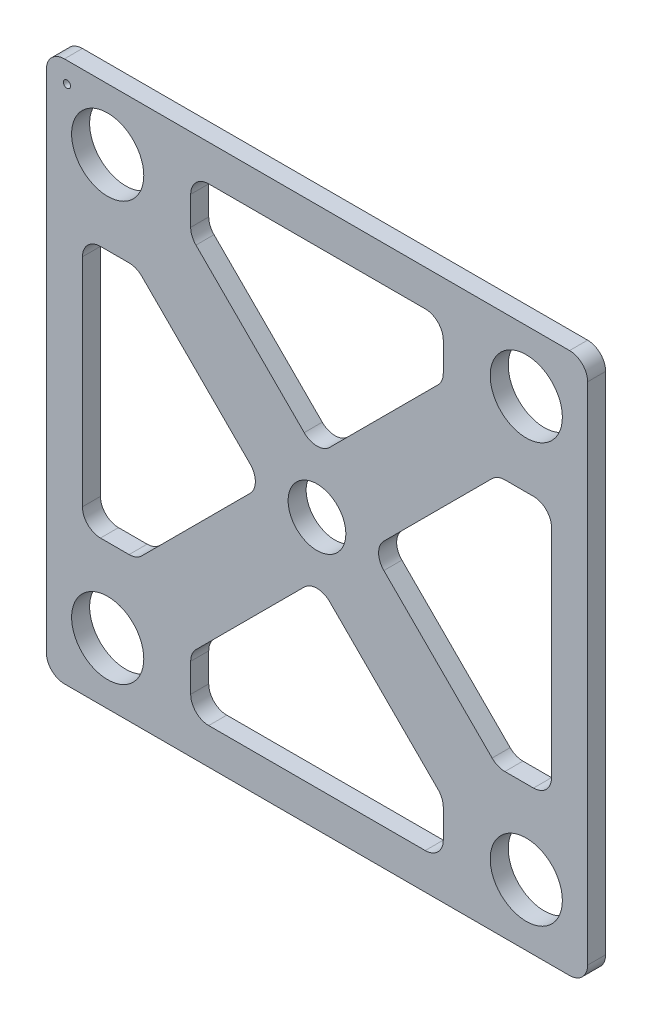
ISO-10303-21;
HEADER;
FILE_DESCRIPTION(('STEP AP214'),'2;1');
FILE_NAME('part.step','',(''),(''),'','','');
FILE_SCHEMA(('AUTOMOTIVE_DESIGN { 1 0 10303 214 1 1 1 1 }'));
ENDSEC;
DATA;
#1=APPLICATION_CONTEXT('core data for automotive mechanical design processes');
#2=APPLICATION_PROTOCOL_DEFINITION('international standard','automotive_design',2000,#1);
#3=PRODUCT_CONTEXT('',#1,'mechanical');
#4=PRODUCT('Part','Part','',(#3));
#5=PRODUCT_RELATED_PRODUCT_CATEGORY('part','',(#4));
#6=PRODUCT_DEFINITION_FORMATION('','',#4);
#7=PRODUCT_DEFINITION_CONTEXT('part definition',#1,'design');
#8=PRODUCT_DEFINITION('design','',#6,#7);
#9=PRODUCT_DEFINITION_SHAPE('','',#8);
#10=(LENGTH_UNIT() NAMED_UNIT(*) SI_UNIT(.MILLI.,.METRE.));
#11=(NAMED_UNIT(*) PLANE_ANGLE_UNIT() SI_UNIT($,.RADIAN.));
#12=(NAMED_UNIT(*) SI_UNIT($,.STERADIAN.) SOLID_ANGLE_UNIT());
#13=UNCERTAINTY_MEASURE_WITH_UNIT(LENGTH_MEASURE(1.E-05),#10,'distance_accuracy_value','');
#14=(GEOMETRIC_REPRESENTATION_CONTEXT(3) GLOBAL_UNCERTAINTY_ASSIGNED_CONTEXT((#13)) GLOBAL_UNIT_ASSIGNED_CONTEXT((#10,
#11,#12)) REPRESENTATION_CONTEXT('',''));
#15=CARTESIAN_POINT('',(0.,0.,0.));
#16=DIRECTION('',(0.,0.,1.));
#17=DIRECTION('',(1.,0.,0.));
#18=AXIS2_PLACEMENT_3D('',#15,#16,#17);
#19=CARTESIAN_POINT('',(-70.,70.,5.));
#20=DIRECTION('',(0.,0.,-1.));
#21=DIRECTION('',(-1.,0.,0.));
#22=AXIS2_PLACEMENT_3D('',#19,#20,#21);
#23=PLANE('',#22);
#24=CARTESIAN_POINT('',(-60.,-30.,5.));
#25=DIRECTION('',(0.,0.,1.));
#26=DIRECTION('',(1.,0.,0.));
#27=AXIS2_PLACEMENT_3D('',#24,#25,#26);
#28=CIRCLE('',#27,5.);
#29=CARTESIAN_POINT('',(-65.,-30.,5.));
#30=VERTEX_POINT('',#29);
#31=CARTESIAN_POINT('',(-59.9999999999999,-35.,5.));
#32=VERTEX_POINT('',#31);
#33=EDGE_CURVE('E420',#30,#32,#28,.T.);
#34=ORIENTED_EDGE('',*,*,#33,.F.);
#35=DIRECTION('',(0.,-1.,0.));
#36=VECTOR('',#35,1.);
#37=CARTESIAN_POINT('',(-65.,29.9999999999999,5.));
#38=LINE('',#37,#36);
#39=CARTESIAN_POINT('',(-65.,29.9999999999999,5.));
#40=VERTEX_POINT('',#39);
#41=EDGE_CURVE('E440',#40,#30,#38,.T.);
#42=ORIENTED_EDGE('',*,*,#41,.F.);
#43=CARTESIAN_POINT('',(-60.,30.,5.));
#44=DIRECTION('',(0.,0.,1.));
#45=DIRECTION('',(1.,0.,0.));
#46=AXIS2_PLACEMENT_3D('',#43,#44,#45);
#47=CIRCLE('',#46,5.);
#48=CARTESIAN_POINT('',(-60.,35.,5.));
#49=VERTEX_POINT('',#48);
#50=EDGE_CURVE('E437',#49,#40,#47,.T.);
#51=ORIENTED_EDGE('',*,*,#50,.F.);
#52=DIRECTION('',(-1.,0.,0.));
#53=VECTOR('',#52,1.);
#54=CARTESIAN_POINT('',(-60.,35.,5.));
#55=LINE('',#54,#53);
#56=CARTESIAN_POINT('',(-52.0710678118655,35.,5.));
#57=VERTEX_POINT('',#56);
#58=EDGE_CURVE('E435',#57,#49,#55,.T.);
#59=ORIENTED_EDGE('',*,*,#58,.F.);
#60=CARTESIAN_POINT('',(-52.0710678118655,30.,5.));
#61=DIRECTION('',(0.,0.,1.));
#62=DIRECTION('',(1.,0.,0.));
#63=AXIS2_PLACEMENT_3D('',#60,#61,#62);
#64=CIRCLE('',#63,4.99999999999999);
#65=CARTESIAN_POINT('',(-48.5355339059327,33.5355339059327,5.));
#66=VERTEX_POINT('',#65);
#67=EDGE_CURVE('E433',#66,#57,#64,.T.);
#68=ORIENTED_EDGE('',*,*,#67,.F.);
#69=DIRECTION('',(-0.707106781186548,0.707106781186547,0.));
#70=VECTOR('',#69,1.);
#71=CARTESIAN_POINT('',(-48.5355339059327,33.5355339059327,5.));
#72=LINE('',#71,#70);
#73=CARTESIAN_POINT('',(-18.5355339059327,3.53553390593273,5.));
#74=VERTEX_POINT('',#73);
#75=EDGE_CURVE('E431',#74,#66,#72,.T.);
#76=ORIENTED_EDGE('',*,*,#75,.F.);
#77=CARTESIAN_POINT('',(-22.0710678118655,0.,5.));
#78=DIRECTION('',(0.,0.,1.));
#79=DIRECTION('',(-1.,0.,0.));
#80=AXIS2_PLACEMENT_3D('',#77,#78,#79);
#81=CIRCLE('',#80,5.);
#82=CARTESIAN_POINT('',(-18.5355339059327,-3.53553390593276,5.));
#83=VERTEX_POINT('',#82);
#84=EDGE_CURVE('E429',#83,#74,#81,.T.);
#85=ORIENTED_EDGE('',*,*,#84,.F.);
#86=DIRECTION('',(0.707106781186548,0.707106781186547,0.));
#87=VECTOR('',#86,1.);
#88=CARTESIAN_POINT('',(-48.5355339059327,-33.5355339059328,5.));
#89=LINE('',#88,#87);
#90=CARTESIAN_POINT('',(-48.5355339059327,-33.5355339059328,5.));
#91=VERTEX_POINT('',#90);
#92=EDGE_CURVE('E427',#91,#83,#89,.T.);
#93=ORIENTED_EDGE('',*,*,#92,.F.);
#94=CARTESIAN_POINT('',(-52.0710678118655,-30.,5.));
#95=DIRECTION('',(0.,0.,1.));
#96=DIRECTION('',(1.,0.,0.));
#97=AXIS2_PLACEMENT_3D('',#94,#95,#96);
#98=CIRCLE('',#97,5.);
#99=CARTESIAN_POINT('',(-52.0710678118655,-35.,5.));
#100=VERTEX_POINT('',#99);
#101=EDGE_CURVE('E425',#100,#91,#98,.T.);
#102=ORIENTED_EDGE('',*,*,#101,.F.);
#103=DIRECTION('',(1.,0.,0.));
#104=VECTOR('',#103,1.);
#105=CARTESIAN_POINT('',(-59.9999999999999,-35.,5.));
#106=LINE('',#105,#104);
#107=EDGE_CURVE('E422',#32,#100,#106,.T.);
#108=ORIENTED_EDGE('',*,*,#107,.F.);
#109=EDGE_LOOP('',(#34,#42,#51,#59,#68,#76,#85,#93,#102,#108));
#110=FACE_BOUND('',#109,.T.);
#111=CARTESIAN_POINT('',(30.,52.0710678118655,5.));
#112=DIRECTION('',(0.,0.,1.));
#113=DIRECTION('',(-1.,0.,0.));
#114=AXIS2_PLACEMENT_3D('',#111,#112,#113);
#115=CIRCLE('',#114,5.);
#116=CARTESIAN_POINT('',(33.5355339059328,48.5355339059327,5.));
#117=VERTEX_POINT('',#116);
#118=CARTESIAN_POINT('',(35.,52.0710678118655,5.));
#119=VERTEX_POINT('',#118);
#120=EDGE_CURVE('E566',#117,#119,#115,.T.);
#121=ORIENTED_EDGE('',*,*,#120,.F.);
#122=DIRECTION('',(0.707106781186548,0.707106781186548,0.));
#123=VECTOR('',#122,1.);
#124=CARTESIAN_POINT('',(33.5355339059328,48.5355339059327,5.));
#125=LINE('',#124,#123);
#126=CARTESIAN_POINT('',(3.53553390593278,18.5355339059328,5.));
#127=VERTEX_POINT('',#126);
#128=EDGE_CURVE('E586',#127,#117,#125,.T.);
#129=ORIENTED_EDGE('',*,*,#128,.F.);
#130=CARTESIAN_POINT('',(0.,22.0710678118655,5.));
#131=DIRECTION('',(0.,0.,1.));
#132=DIRECTION('',(-1.,0.,0.));
#133=AXIS2_PLACEMENT_3D('',#130,#131,#132);
#134=CIRCLE('',#133,5.);
#135=CARTESIAN_POINT('',(-3.53553390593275,18.5355339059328,5.));
#136=VERTEX_POINT('',#135);
#137=EDGE_CURVE('E583',#136,#127,#134,.T.);
#138=ORIENTED_EDGE('',*,*,#137,.F.);
#139=DIRECTION('',(0.707106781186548,-0.707106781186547,0.));
#140=VECTOR('',#139,1.);
#141=CARTESIAN_POINT('',(-33.5355339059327,48.5355339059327,5.));
#142=LINE('',#141,#140);
#143=CARTESIAN_POINT('',(-33.5355339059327,48.5355339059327,5.));
#144=VERTEX_POINT('',#143);
#145=EDGE_CURVE('E581',#144,#136,#142,.T.);
#146=ORIENTED_EDGE('',*,*,#145,.F.);
#147=CARTESIAN_POINT('',(-30.,52.0710678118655,5.));
#148=DIRECTION('',(0.,0.,1.));
#149=DIRECTION('',(1.,0.,0.));
#150=AXIS2_PLACEMENT_3D('',#147,#148,#149);
#151=CIRCLE('',#150,5.);
#152=CARTESIAN_POINT('',(-35.,52.0710678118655,5.));
#153=VERTEX_POINT('',#152);
#154=EDGE_CURVE('E579',#153,#144,#151,.T.);
#155=ORIENTED_EDGE('',*,*,#154,.F.);
#156=DIRECTION('',(0.,-1.,0.));
#157=VECTOR('',#156,1.);
#158=CARTESIAN_POINT('',(-35.,60.,5.));
#159=LINE('',#158,#157);
#160=CARTESIAN_POINT('',(-35.,60.,5.));
#161=VERTEX_POINT('',#160);
#162=EDGE_CURVE('E577',#161,#153,#159,.T.);
#163=ORIENTED_EDGE('',*,*,#162,.F.);
#164=CARTESIAN_POINT('',(-30.,60.,5.));
#165=DIRECTION('',(0.,0.,1.));
#166=DIRECTION('',(1.,0.,0.));
#167=AXIS2_PLACEMENT_3D('',#164,#165,#166);
#168=CIRCLE('',#167,5.);
#169=CARTESIAN_POINT('',(-30.,65.,5.));
#170=VERTEX_POINT('',#169);
#171=EDGE_CURVE('E575',#170,#161,#168,.T.);
#172=ORIENTED_EDGE('',*,*,#171,.F.);
#173=DIRECTION('',(-1.,0.,0.));
#174=VECTOR('',#173,1.);
#175=CARTESIAN_POINT('',(-30.,65.,5.));
#176=LINE('',#175,#174);
#177=CARTESIAN_POINT('',(30.,65.,5.));
#178=VERTEX_POINT('',#177);
#179=EDGE_CURVE('E573',#178,#170,#176,.T.);
#180=ORIENTED_EDGE('',*,*,#179,.F.);
#181=CARTESIAN_POINT('',(30.,60.,5.));
#182=DIRECTION('',(0.,0.,1.));
#183=DIRECTION('',(-1.,0.,0.));
#184=AXIS2_PLACEMENT_3D('',#181,#182,#183);
#185=CIRCLE('',#184,5.);
#186=CARTESIAN_POINT('',(35.,60.,5.));
#187=VERTEX_POINT('',#186);
#188=EDGE_CURVE('E571',#187,#178,#185,.T.);
#189=ORIENTED_EDGE('',*,*,#188,.F.);
#190=DIRECTION('',(0.,1.,0.));
#191=VECTOR('',#190,1.);
#192=CARTESIAN_POINT('',(35.,60.,5.));
#193=LINE('',#192,#191);
#194=EDGE_CURVE('E568',#119,#187,#193,.T.);
#195=ORIENTED_EDGE('',*,*,#194,.F.);
#196=EDGE_LOOP('',(#121,#129,#138,#146,#155,#163,#172,#180,#189,#195));
#197=FACE_BOUND('',#196,.T.);
#198=CARTESIAN_POINT('',(-70.,70.,5.));
#199=DIRECTION('',(0.,0.,1.));
#200=DIRECTION('',(-1.,0.,0.));
#201=AXIS2_PLACEMENT_3D('',#198,#199,#200);
#202=CIRCLE('',#201,5.);
#203=CARTESIAN_POINT('',(-70.,75.,5.));
#204=VERTEX_POINT('',#203);
#205=CARTESIAN_POINT('',(-75.,70.,5.));
#206=VERTEX_POINT('',#205);
#207=EDGE_CURVE('E663',#204,#206,#202,.T.);
#208=ORIENTED_EDGE('',*,*,#207,.T.);
#209=DIRECTION('',(0.,-1.,0.));
#210=VECTOR('',#209,1.);
#211=CARTESIAN_POINT('',(-75.,-70.,5.));
#212=LINE('',#211,#210);
#213=CARTESIAN_POINT('',(-75.,-70.,5.));
#214=VERTEX_POINT('',#213);
#215=EDGE_CURVE('E666',#206,#214,#212,.T.);
#216=ORIENTED_EDGE('',*,*,#215,.T.);
#217=CARTESIAN_POINT('',(-70.,-70.,5.));
#218=DIRECTION('',(0.,0.,1.));
#219=DIRECTION('',(-1.,0.,0.));
#220=AXIS2_PLACEMENT_3D('',#217,#218,#219);
#221=CIRCLE('',#220,5.);
#222=CARTESIAN_POINT('',(-70.,-75.,5.));
#223=VERTEX_POINT('',#222);
#224=EDGE_CURVE('E669',#214,#223,#221,.T.);
#225=ORIENTED_EDGE('',*,*,#224,.T.);
#226=DIRECTION('',(1.,0.,0.));
#227=VECTOR('',#226,1.);
#228=CARTESIAN_POINT('',(-70.,-75.,5.));
#229=LINE('',#228,#227);
#230=CARTESIAN_POINT('',(70.,-75.,5.));
#231=VERTEX_POINT('',#230);
#232=EDGE_CURVE('E671',#223,#231,#229,.T.);
#233=ORIENTED_EDGE('',*,*,#232,.T.);
#234=CARTESIAN_POINT('',(70.,-70.,5.));
#235=DIRECTION('',(0.,0.,1.));
#236=DIRECTION('',(1.,0.,0.));
#237=AXIS2_PLACEMENT_3D('',#234,#235,#236);
#238=CIRCLE('',#237,5.);
#239=CARTESIAN_POINT('',(75.,-70.,5.));
#240=VERTEX_POINT('',#239);
#241=EDGE_CURVE('E673',#231,#240,#238,.T.);
#242=ORIENTED_EDGE('',*,*,#241,.T.);
#243=DIRECTION('',(0.,1.,0.));
#244=VECTOR('',#243,1.);
#245=CARTESIAN_POINT('',(75.,-70.,5.));
#246=LINE('',#245,#244);
#247=CARTESIAN_POINT('',(75.,70.,5.));
#248=VERTEX_POINT('',#247);
#249=EDGE_CURVE('E675',#240,#248,#246,.T.);
#250=ORIENTED_EDGE('',*,*,#249,.T.);
#251=CARTESIAN_POINT('',(70.,70.,5.));
#252=DIRECTION('',(0.,0.,1.));
#253=DIRECTION('',(-1.,0.,0.));
#254=AXIS2_PLACEMENT_3D('',#251,#252,#253);
#255=CIRCLE('',#254,5.);
#256=CARTESIAN_POINT('',(70.,75.,5.));
#257=VERTEX_POINT('',#256);
#258=EDGE_CURVE('E677',#248,#257,#255,.T.);
#259=ORIENTED_EDGE('',*,*,#258,.T.);
#260=DIRECTION('',(-1.,0.,0.));
#261=VECTOR('',#260,1.);
#262=CARTESIAN_POINT('',(-70.,75.,5.));
#263=LINE('',#262,#261);
#264=EDGE_CURVE('E679',#257,#204,#263,.T.);
#265=ORIENTED_EDGE('',*,*,#264,.T.);
#266=EDGE_LOOP('',(#208,#216,#225,#233,#242,#250,#259,#265));
#267=FACE_BOUND('',#266,.T.);
#268=CARTESIAN_POINT('',(-58.,58.,5.));
#269=DIRECTION('',(0.,0.,1.));
#270=DIRECTION('',(1.,0.,0.));
#271=AXIS2_PLACEMENT_3D('',#268,#269,#270);
#272=CIRCLE('',#271,10.);
#273=CARTESIAN_POINT('',(-48.,58.,5.));
#274=VERTEX_POINT('',#273);
#275=EDGE_CURVE('E657',#274,#274,#272,.T.);
#276=ORIENTED_EDGE('',*,*,#275,.F.);
#277=EDGE_LOOP('',(#276));
#278=FACE_BOUND('',#277,.T.);
#279=CARTESIAN_POINT('',(58.,58.,5.));
#280=DIRECTION('',(0.,0.,1.));
#281=DIRECTION('',(1.,0.,0.));
#282=AXIS2_PLACEMENT_3D('',#279,#280,#281);
#283=CIRCLE('',#282,10.);
#284=CARTESIAN_POINT('',(68.,58.,5.));
#285=VERTEX_POINT('',#284);
#286=EDGE_CURVE('E651',#285,#285,#283,.T.);
#287=ORIENTED_EDGE('',*,*,#286,.F.);
#288=EDGE_LOOP('',(#287));
#289=FACE_BOUND('',#288,.T.);
#290=CARTESIAN_POINT('',(58.,-58.0000000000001,5.));
#291=DIRECTION('',(0.,0.,1.));
#292=DIRECTION('',(1.,0.,0.));
#293=AXIS2_PLACEMENT_3D('',#290,#291,#292);
#294=CIRCLE('',#293,9.99999999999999);
#295=CARTESIAN_POINT('',(68.,-58.0000000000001,5.));
#296=VERTEX_POINT('',#295);
#297=EDGE_CURVE('E645',#296,#296,#294,.T.);
#298=ORIENTED_EDGE('',*,*,#297,.F.);
#299=EDGE_LOOP('',(#298));
#300=FACE_BOUND('',#299,.T.);
#301=CARTESIAN_POINT('',(-58.,-58.,5.));
#302=DIRECTION('',(0.,0.,1.));
#303=DIRECTION('',(1.,0.,0.));
#304=AXIS2_PLACEMENT_3D('',#301,#302,#303);
#305=CIRCLE('',#304,10.);
#306=CARTESIAN_POINT('',(-48.,-58.,5.));
#307=VERTEX_POINT('',#306);
#308=EDGE_CURVE('E639',#307,#307,#305,.T.);
#309=ORIENTED_EDGE('',*,*,#308,.F.);
#310=EDGE_LOOP('',(#309));
#311=FACE_BOUND('',#310,.T.);
#312=CARTESIAN_POINT('',(-30.,-52.0710678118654,5.));
#313=DIRECTION('',(0.,0.,1.));
#314=DIRECTION('',(-1.,0.,0.));
#315=AXIS2_PLACEMENT_3D('',#312,#313,#314);
#316=CIRCLE('',#315,5.);
#317=CARTESIAN_POINT('',(-33.5355339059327,-48.5355339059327,5.));
#318=VERTEX_POINT('',#317);
#319=CARTESIAN_POINT('',(-35.,-52.0710678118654,5.));
#320=VERTEX_POINT('',#319);
#321=EDGE_CURVE('E493',#318,#320,#316,.T.);
#322=ORIENTED_EDGE('',*,*,#321,.F.);
#323=DIRECTION('',(-0.707106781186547,-0.707106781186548,0.));
#324=VECTOR('',#323,1.);
#325=CARTESIAN_POINT('',(-33.5355339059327,-48.5355339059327,5.));
#326=LINE('',#325,#324);
#327=CARTESIAN_POINT('',(-3.53553390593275,-18.5355339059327,5.));
#328=VERTEX_POINT('',#327);
#329=EDGE_CURVE('E513',#328,#318,#326,.T.);
#330=ORIENTED_EDGE('',*,*,#329,.F.);
#331=CARTESIAN_POINT('',(0.,-22.0710678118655,5.));
#332=DIRECTION('',(0.,0.,1.));
#333=DIRECTION('',(1.,0.,0.));
#334=AXIS2_PLACEMENT_3D('',#331,#332,#333);
#335=CIRCLE('',#334,5.);
#336=CARTESIAN_POINT('',(3.53553390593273,-18.5355339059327,5.));
#337=VERTEX_POINT('',#336);
#338=EDGE_CURVE('E510',#337,#328,#335,.T.);
#339=ORIENTED_EDGE('',*,*,#338,.F.);
#340=DIRECTION('',(-0.707106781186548,0.707106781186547,0.));
#341=VECTOR('',#340,1.);
#342=CARTESIAN_POINT('',(33.5355339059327,-48.5355339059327,5.));
#343=LINE('',#342,#341);
#344=CARTESIAN_POINT('',(33.5355339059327,-48.5355339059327,5.));
#345=VERTEX_POINT('',#344);
#346=EDGE_CURVE('E508',#345,#337,#343,.T.);
#347=ORIENTED_EDGE('',*,*,#346,.F.);
#348=CARTESIAN_POINT('',(30.,-52.0710678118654,5.));
#349=DIRECTION('',(0.,0.,1.));
#350=DIRECTION('',(-1.,0.,0.));
#351=AXIS2_PLACEMENT_3D('',#348,#349,#350);
#352=CIRCLE('',#351,5.00000000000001);
#353=CARTESIAN_POINT('',(35.,-52.0710678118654,5.));
#354=VERTEX_POINT('',#353);
#355=EDGE_CURVE('E506',#354,#345,#352,.T.);
#356=ORIENTED_EDGE('',*,*,#355,.F.);
#357=DIRECTION('',(0.,1.,0.));
#358=VECTOR('',#357,1.);
#359=CARTESIAN_POINT('',(35.,-60.,5.));
#360=LINE('',#359,#358);
#361=CARTESIAN_POINT('',(35.,-60.,5.));
#362=VERTEX_POINT('',#361);
#363=EDGE_CURVE('E504',#362,#354,#360,.T.);
#364=ORIENTED_EDGE('',*,*,#363,.F.);
#365=CARTESIAN_POINT('',(30.,-60.0000000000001,5.));
#366=DIRECTION('',(0.,0.,1.));
#367=DIRECTION('',(-1.,0.,0.));
#368=AXIS2_PLACEMENT_3D('',#365,#366,#367);
#369=CIRCLE('',#368,5.);
#370=CARTESIAN_POINT('',(29.9999999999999,-65.0000000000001,5.));
#371=VERTEX_POINT('',#370);
#372=EDGE_CURVE('E502',#371,#362,#369,.T.);
#373=ORIENTED_EDGE('',*,*,#372,.F.);
#374=DIRECTION('',(1.,0.,0.));
#375=VECTOR('',#374,1.);
#376=CARTESIAN_POINT('',(29.9999999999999,-65.0000000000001,5.));
#377=LINE('',#376,#375);
#378=CARTESIAN_POINT('',(-30.,-65.,5.));
#379=VERTEX_POINT('',#378);
#380=EDGE_CURVE('E500',#379,#371,#377,.T.);
#381=ORIENTED_EDGE('',*,*,#380,.F.);
#382=CARTESIAN_POINT('',(-30.,-60.,5.));
#383=DIRECTION('',(0.,0.,1.));
#384=DIRECTION('',(-1.,0.,0.));
#385=AXIS2_PLACEMENT_3D('',#382,#383,#384);
#386=CIRCLE('',#385,5.);
#387=CARTESIAN_POINT('',(-35.,-60.,5.));
#388=VERTEX_POINT('',#387);
#389=EDGE_CURVE('E498',#388,#379,#386,.T.);
#390=ORIENTED_EDGE('',*,*,#389,.F.);
#391=DIRECTION('',(0.,-1.,0.));
#392=VECTOR('',#391,1.);
#393=CARTESIAN_POINT('',(-35.,-60.,5.));
#394=LINE('',#393,#392);
#395=EDGE_CURVE('E495',#320,#388,#394,.T.);
#396=ORIENTED_EDGE('',*,*,#395,.F.);
#397=EDGE_LOOP('',(#322,#330,#339,#347,#356,#364,#373,#381,#390,#396));
#398=FACE_BOUND('',#397,.T.);
#399=CARTESIAN_POINT('',(22.0710678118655,0.,5.));
#400=DIRECTION('',(0.,0.,1.));
#401=DIRECTION('',(1.,0.,0.));
#402=AXIS2_PLACEMENT_3D('',#399,#400,#401);
#403=CIRCLE('',#402,5.);
#404=CARTESIAN_POINT('',(18.5355339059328,3.53553390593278,5.));
#405=VERTEX_POINT('',#404);
#406=CARTESIAN_POINT('',(18.5355339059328,-3.53553390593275,5.));
#407=VERTEX_POINT('',#406);
#408=EDGE_CURVE('E338',#405,#407,#403,.T.);
#409=ORIENTED_EDGE('',*,*,#408,.F.);
#410=DIRECTION('',(-0.707106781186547,-0.707106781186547,0.));
#411=VECTOR('',#410,1.);
#412=CARTESIAN_POINT('',(48.5355339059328,33.5355339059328,5.));
#413=LINE('',#412,#411);
#414=CARTESIAN_POINT('',(48.5355339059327,33.5355339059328,5.));
#415=VERTEX_POINT('',#414);
#416=EDGE_CURVE('E377',#415,#405,#413,.T.);
#417=ORIENTED_EDGE('',*,*,#416,.F.);
#418=CARTESIAN_POINT('',(52.0710678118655,30.,5.));
#419=DIRECTION('',(0.,0.,1.));
#420=DIRECTION('',(-1.,0.,0.));
#421=AXIS2_PLACEMENT_3D('',#418,#419,#420);
#422=CIRCLE('',#421,5.);
#423=CARTESIAN_POINT('',(52.0710678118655,35.,5.));
#424=VERTEX_POINT('',#423);
#425=EDGE_CURVE('E375',#424,#415,#422,.T.);
#426=ORIENTED_EDGE('',*,*,#425,.F.);
#427=DIRECTION('',(-1.,0.,0.));
#428=VECTOR('',#427,1.);
#429=CARTESIAN_POINT('',(60.,35.,5.));
#430=LINE('',#429,#428);
#431=CARTESIAN_POINT('',(60.,35.,5.));
#432=VERTEX_POINT('',#431);
#433=EDGE_CURVE('E373',#432,#424,#430,.T.);
#434=ORIENTED_EDGE('',*,*,#433,.F.);
#435=CARTESIAN_POINT('',(60.,30.,5.));
#436=DIRECTION('',(0.,0.,1.));
#437=DIRECTION('',(-1.,0.,0.));
#438=AXIS2_PLACEMENT_3D('',#435,#436,#437);
#439=CIRCLE('',#438,5.);
#440=CARTESIAN_POINT('',(65.,30.,5.));
#441=VERTEX_POINT('',#440);
#442=EDGE_CURVE('E371',#441,#432,#439,.T.);
#443=ORIENTED_EDGE('',*,*,#442,.F.);
#444=DIRECTION('',(0.,1.,0.));
#445=VECTOR('',#444,1.);
#446=CARTESIAN_POINT('',(65.0000000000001,-29.9999999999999,5.));
#447=LINE('',#446,#445);
#448=CARTESIAN_POINT('',(65.0000000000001,-29.9999999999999,5.));
#449=VERTEX_POINT('',#448);
#450=EDGE_CURVE('E369',#449,#441,#447,.T.);
#451=ORIENTED_EDGE('',*,*,#450,.F.);
#452=CARTESIAN_POINT('',(60.0000000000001,-30.,5.));
#453=DIRECTION('',(0.,0.,1.));
#454=DIRECTION('',(-1.,0.,0.));
#455=AXIS2_PLACEMENT_3D('',#452,#453,#454);
#456=CIRCLE('',#455,5.);
#457=CARTESIAN_POINT('',(60.,-35.,5.));
#458=VERTEX_POINT('',#457);
#459=EDGE_CURVE('E367',#458,#449,#456,.T.);
#460=ORIENTED_EDGE('',*,*,#459,.F.);
#461=DIRECTION('',(1.,0.,0.));
#462=VECTOR('',#461,1.);
#463=CARTESIAN_POINT('',(60.,-35.,5.));
#464=LINE('',#463,#462);
#465=CARTESIAN_POINT('',(52.0710678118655,-35.,5.));
#466=VERTEX_POINT('',#465);
#467=EDGE_CURVE('E362',#466,#458,#464,.T.);
#468=ORIENTED_EDGE('',*,*,#467,.F.);
#469=CARTESIAN_POINT('',(52.0710678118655,-30.,5.));
#470=DIRECTION('',(0.,0.,1.));
#471=DIRECTION('',(-1.,0.,0.));
#472=AXIS2_PLACEMENT_3D('',#469,#470,#471);
#473=CIRCLE('',#472,5.);
#474=CARTESIAN_POINT('',(48.5355339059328,-33.5355339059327,5.));
#475=VERTEX_POINT('',#474);
#476=EDGE_CURVE('E360',#475,#466,#473,.T.);
#477=ORIENTED_EDGE('',*,*,#476,.F.);
#478=DIRECTION('',(0.707106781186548,-0.707106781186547,0.));
#479=VECTOR('',#478,1.);
#480=CARTESIAN_POINT('',(48.5355339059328,-33.5355339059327,5.));
#481=LINE('',#480,#479);
#482=EDGE_CURVE('E346',#407,#475,#481,.T.);
#483=ORIENTED_EDGE('',*,*,#482,.F.);
#484=EDGE_LOOP('',(#409,#417,#426,#434,#443,#451,#460,#468,#477,#483));
#485=FACE_BOUND('',#484,.T.);
#486=CARTESIAN_POINT('',(0.,0.,5.));
#487=DIRECTION('',(0.,0.,1.));
#488=DIRECTION('',(1.,0.,0.));
#489=AXIS2_PLACEMENT_3D('',#486,#487,#488);
#490=CIRCLE('',#489,8.);
#491=CARTESIAN_POINT('',(8.00000000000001,0.,5.));
#492=VERTEX_POINT('',#491);
#493=EDGE_CURVE('E380',#492,#492,#490,.T.);
#494=ORIENTED_EDGE('',*,*,#493,.F.);
#495=EDGE_LOOP('',(#494));
#496=FACE_BOUND('',#495,.T.);
#497=CARTESIAN_POINT('',(-69.2964645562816,69.2964645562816,5.));
#498=DIRECTION('',(0.,0.,1.));
#499=DIRECTION('',(1.,0.,0.));
#500=AXIS2_PLACEMENT_3D('',#497,#498,#499);
#501=CIRCLE('',#500,0.999999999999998);
#502=CARTESIAN_POINT('',(-68.2964645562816,69.2964645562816,5.));
#503=VERTEX_POINT('',#502);
#504=EDGE_CURVE('E1245',#503,#503,#501,.T.);
#505=ORIENTED_EDGE('',*,*,#504,.F.);
#506=EDGE_LOOP('',(#505));
#507=FACE_BOUND('',#506,.T.);
#508=ADVANCED_FACE('F33',(#110,#197,#267,#278,#289,#300,#311,#398,#485,#496,#507),#23,.F.);
#509=CARTESIAN_POINT('',(-70.,70.,0.));
#510=DIRECTION('',(0.,0.,-1.));
#511=DIRECTION('',(-1.,0.,0.));
#512=AXIS2_PLACEMENT_3D('',#509,#510,#511);
#513=PLANE('',#512);
#514=CARTESIAN_POINT('',(0.,0.,0.));
#515=DIRECTION('',(0.,0.,1.));
#516=DIRECTION('',(1.,0.,0.));
#517=AXIS2_PLACEMENT_3D('',#514,#515,#516);
#518=CIRCLE('',#517,8.);
#519=CARTESIAN_POINT('',(8.00000000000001,0.,0.));
#520=VERTEX_POINT('',#519);
#521=EDGE_CURVE('E1251',#520,#520,#518,.T.);
#522=ORIENTED_EDGE('',*,*,#521,.T.);
#523=EDGE_LOOP('',(#522));
#524=FACE_BOUND('',#523,.T.);
#525=CARTESIAN_POINT('',(58.,-58.0000000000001,0.));
#526=DIRECTION('',(0.,0.,1.));
#527=DIRECTION('',(1.,0.,0.));
#528=AXIS2_PLACEMENT_3D('',#525,#526,#527);
#529=CIRCLE('',#528,9.99999999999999);
#530=CARTESIAN_POINT('',(68.,-58.0000000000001,0.));
#531=VERTEX_POINT('',#530);
#532=EDGE_CURVE('E642',#531,#531,#529,.T.);
#533=ORIENTED_EDGE('',*,*,#532,.T.);
#534=EDGE_LOOP('',(#533));
#535=FACE_BOUND('',#534,.T.);
#536=CARTESIAN_POINT('',(-58.,58.,0.));
#537=DIRECTION('',(0.,0.,1.));
#538=DIRECTION('',(1.,0.,0.));
#539=AXIS2_PLACEMENT_3D('',#536,#537,#538);
#540=CIRCLE('',#539,10.);
#541=CARTESIAN_POINT('',(-48.,58.,0.));
#542=VERTEX_POINT('',#541);
#543=EDGE_CURVE('E654',#542,#542,#540,.T.);
#544=ORIENTED_EDGE('',*,*,#543,.T.);
#545=EDGE_LOOP('',(#544));
#546=FACE_BOUND('',#545,.T.);
#547=CARTESIAN_POINT('',(-70.,70.,0.));
#548=DIRECTION('',(0.,0.,1.));
#549=DIRECTION('',(-1.,0.,0.));
#550=AXIS2_PLACEMENT_3D('',#547,#548,#549);
#551=CIRCLE('',#550,5.);
#552=CARTESIAN_POINT('',(-70.,75.,0.));
#553=VERTEX_POINT('',#552);
#554=CARTESIAN_POINT('',(-75.,70.,0.));
#555=VERTEX_POINT('',#554);
#556=EDGE_CURVE('E660',#553,#555,#551,.T.);
#557=ORIENTED_EDGE('',*,*,#556,.F.);
#558=DIRECTION('',(-1.,0.,0.));
#559=VECTOR('',#558,1.);
#560=CARTESIAN_POINT('',(-70.,75.,0.));
#561=LINE('',#560,#559);
#562=CARTESIAN_POINT('',(70.,75.,0.));
#563=VERTEX_POINT('',#562);
#564=EDGE_CURVE('E667',#563,#553,#561,.T.);
#565=ORIENTED_EDGE('',*,*,#564,.F.);
#566=CARTESIAN_POINT('',(70.,70.,0.));
#567=DIRECTION('',(0.,0.,1.));
#568=DIRECTION('',(-1.,0.,0.));
#569=AXIS2_PLACEMENT_3D('',#566,#567,#568);
#570=CIRCLE('',#569,5.);
#571=CARTESIAN_POINT('',(75.,70.,0.));
#572=VERTEX_POINT('',#571);
#573=EDGE_CURVE('E694',#572,#563,#570,.T.);
#574=ORIENTED_EDGE('',*,*,#573,.F.);
#575=DIRECTION('',(0.,1.,0.));
#576=VECTOR('',#575,1.);
#577=CARTESIAN_POINT('',(75.,-70.,0.));
#578=LINE('',#577,#576);
#579=CARTESIAN_POINT('',(75.,-70.,0.));
#580=VERTEX_POINT('',#579);
#581=EDGE_CURVE('E692',#580,#572,#578,.T.);
#582=ORIENTED_EDGE('',*,*,#581,.F.);
#583=CARTESIAN_POINT('',(70.,-70.,0.));
#584=DIRECTION('',(0.,0.,1.));
#585=DIRECTION('',(1.,0.,0.));
#586=AXIS2_PLACEMENT_3D('',#583,#584,#585);
#587=CIRCLE('',#586,5.);
#588=CARTESIAN_POINT('',(70.,-75.,0.));
#589=VERTEX_POINT('',#588);
#590=EDGE_CURVE('E690',#589,#580,#587,.T.);
#591=ORIENTED_EDGE('',*,*,#590,.F.);
#592=DIRECTION('',(1.,0.,0.));
#593=VECTOR('',#592,1.);
#594=CARTESIAN_POINT('',(-70.,-75.,0.));
#595=LINE('',#594,#593);
#596=CARTESIAN_POINT('',(-70.,-75.,0.));
#597=VERTEX_POINT('',#596);
#598=EDGE_CURVE('E688',#597,#589,#595,.T.);
#599=ORIENTED_EDGE('',*,*,#598,.F.);
#600=CARTESIAN_POINT('',(-70.,-70.,0.));
#601=DIRECTION('',(0.,0.,1.));
#602=DIRECTION('',(-1.,0.,0.));
#603=AXIS2_PLACEMENT_3D('',#600,#601,#602);
#604=CIRCLE('',#603,5.);
#605=CARTESIAN_POINT('',(-75.,-70.,0.));
#606=VERTEX_POINT('',#605);
#607=EDGE_CURVE('E686',#606,#597,#604,.T.);
#608=ORIENTED_EDGE('',*,*,#607,.F.);
#609=DIRECTION('',(0.,-1.,0.));
#610=VECTOR('',#609,1.);
#611=CARTESIAN_POINT('',(-75.,-70.,0.));
#612=LINE('',#611,#610);
#613=EDGE_CURVE('E684',#555,#606,#612,.T.);
#614=ORIENTED_EDGE('',*,*,#613,.F.);
#615=EDGE_LOOP('',(#557,#565,#574,#582,#591,#599,#608,#614));
#616=FACE_BOUND('',#615,.T.);
#617=CARTESIAN_POINT('',(58.,58.,0.));
#618=DIRECTION('',(0.,0.,1.));
#619=DIRECTION('',(1.,0.,0.));
#620=AXIS2_PLACEMENT_3D('',#617,#618,#619);
#621=CIRCLE('',#620,10.);
#622=CARTESIAN_POINT('',(68.,58.,0.));
#623=VERTEX_POINT('',#622);
#624=EDGE_CURVE('E648',#623,#623,#621,.T.);
#625=ORIENTED_EDGE('',*,*,#624,.T.);
#626=EDGE_LOOP('',(#625));
#627=FACE_BOUND('',#626,.T.);
#628=CARTESIAN_POINT('',(-58.,-58.,0.));
#629=DIRECTION('',(0.,0.,1.));
#630=DIRECTION('',(1.,0.,0.));
#631=AXIS2_PLACEMENT_3D('',#628,#629,#630);
#632=CIRCLE('',#631,10.);
#633=CARTESIAN_POINT('',(-48.,-58.,0.));
#634=VERTEX_POINT('',#633);
#635=EDGE_CURVE('E638',#634,#634,#632,.T.);
#636=ORIENTED_EDGE('',*,*,#635,.T.);
#637=EDGE_LOOP('',(#636));
#638=FACE_BOUND('',#637,.T.);
#639=DIRECTION('',(0.707106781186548,0.707106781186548,0.));
#640=VECTOR('',#639,1.);
#641=CARTESIAN_POINT('',(33.5355339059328,48.5355339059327,0.));
#642=LINE('',#641,#640);
#643=CARTESIAN_POINT('',(3.53553390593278,18.5355339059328,0.));
#644=VERTEX_POINT('',#643);
#645=CARTESIAN_POINT('',(33.5355339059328,48.5355339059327,0.));
#646=VERTEX_POINT('',#645);
#647=EDGE_CURVE('E569',#644,#646,#642,.T.);
#648=ORIENTED_EDGE('',*,*,#647,.T.);
#649=CARTESIAN_POINT('',(30.,52.0710678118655,0.));
#650=DIRECTION('',(0.,0.,1.));
#651=DIRECTION('',(-1.,0.,0.));
#652=AXIS2_PLACEMENT_3D('',#649,#650,#651);
#653=CIRCLE('',#652,5.);
#654=CARTESIAN_POINT('',(35.,52.0710678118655,0.));
#655=VERTEX_POINT('',#654);
#656=EDGE_CURVE('E565',#646,#655,#653,.T.);
#657=ORIENTED_EDGE('',*,*,#656,.T.);
#658=DIRECTION('',(0.,1.,0.));
#659=VECTOR('',#658,1.);
#660=CARTESIAN_POINT('',(35.,60.,0.));
#661=LINE('',#660,#659);
#662=CARTESIAN_POINT('',(35.,60.,0.));
#663=VERTEX_POINT('',#662);
#664=EDGE_CURVE('E591',#655,#663,#661,.T.);
#665=ORIENTED_EDGE('',*,*,#664,.T.);
#666=CARTESIAN_POINT('',(30.,60.,0.));
#667=DIRECTION('',(0.,0.,1.));
#668=DIRECTION('',(-1.,0.,0.));
#669=AXIS2_PLACEMENT_3D('',#666,#667,#668);
#670=CIRCLE('',#669,5.);
#671=CARTESIAN_POINT('',(30.,65.,0.));
#672=VERTEX_POINT('',#671);
#673=EDGE_CURVE('E594',#663,#672,#670,.T.);
#674=ORIENTED_EDGE('',*,*,#673,.T.);
#675=DIRECTION('',(-1.,0.,0.));
#676=VECTOR('',#675,1.);
#677=CARTESIAN_POINT('',(-30.,65.,0.));
#678=LINE('',#677,#676);
#679=CARTESIAN_POINT('',(-30.,65.,0.));
#680=VERTEX_POINT('',#679);
#681=EDGE_CURVE('E597',#672,#680,#678,.T.);
#682=ORIENTED_EDGE('',*,*,#681,.T.);
#683=CARTESIAN_POINT('',(-30.,60.,0.));
#684=DIRECTION('',(0.,0.,1.));
#685=DIRECTION('',(1.,0.,0.));
#686=AXIS2_PLACEMENT_3D('',#683,#684,#685);
#687=CIRCLE('',#686,5.);
#688=CARTESIAN_POINT('',(-35.,60.,0.));
#689=VERTEX_POINT('',#688);
#690=EDGE_CURVE('E600',#680,#689,#687,.T.);
#691=ORIENTED_EDGE('',*,*,#690,.T.);
#692=DIRECTION('',(0.,-1.,0.));
#693=VECTOR('',#692,1.);
#694=CARTESIAN_POINT('',(-35.,60.,0.));
#695=LINE('',#694,#693);
#696=CARTESIAN_POINT('',(-35.,52.0710678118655,0.));
#697=VERTEX_POINT('',#696);
#698=EDGE_CURVE('E603',#689,#697,#695,.T.);
#699=ORIENTED_EDGE('',*,*,#698,.T.);
#700=CARTESIAN_POINT('',(-30.,52.0710678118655,0.));
#701=DIRECTION('',(0.,0.,1.));
#702=DIRECTION('',(1.,0.,0.));
#703=AXIS2_PLACEMENT_3D('',#700,#701,#702);
#704=CIRCLE('',#703,5.);
#705=CARTESIAN_POINT('',(-33.5355339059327,48.5355339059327,0.));
#706=VERTEX_POINT('',#705);
#707=EDGE_CURVE('E606',#697,#706,#704,.T.);
#708=ORIENTED_EDGE('',*,*,#707,.T.);
#709=DIRECTION('',(0.707106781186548,-0.707106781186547,0.));
#710=VECTOR('',#709,1.);
#711=CARTESIAN_POINT('',(-33.5355339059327,48.5355339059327,0.));
#712=LINE('',#711,#710);
#713=CARTESIAN_POINT('',(-3.53553390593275,18.5355339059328,0.));
#714=VERTEX_POINT('',#713);
#715=EDGE_CURVE('E609',#706,#714,#712,.T.);
#716=ORIENTED_EDGE('',*,*,#715,.T.);
#717=CARTESIAN_POINT('',(0.,22.0710678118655,0.));
#718=DIRECTION('',(0.,0.,1.));
#719=DIRECTION('',(-1.,0.,0.));
#720=AXIS2_PLACEMENT_3D('',#717,#718,#719);
#721=CIRCLE('',#720,5.);
#722=EDGE_CURVE('E612',#714,#644,#721,.T.);
#723=ORIENTED_EDGE('',*,*,#722,.T.);
#724=EDGE_LOOP('',(#648,#657,#665,#674,#682,#691,#699,#708,#716,#723));
#725=FACE_BOUND('',#724,.T.);
#726=DIRECTION('',(-0.707106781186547,-0.707106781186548,0.));
#727=VECTOR('',#726,1.);
#728=CARTESIAN_POINT('',(-33.5355339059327,-48.5355339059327,0.));
#729=LINE('',#728,#727);
#730=CARTESIAN_POINT('',(-3.53553390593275,-18.5355339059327,0.));
#731=VERTEX_POINT('',#730);
#732=CARTESIAN_POINT('',(-33.5355339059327,-48.5355339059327,0.));
#733=VERTEX_POINT('',#732);
#734=EDGE_CURVE('E496',#731,#733,#729,.T.);
#735=ORIENTED_EDGE('',*,*,#734,.T.);
#736=CARTESIAN_POINT('',(-30.,-52.0710678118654,0.));
#737=DIRECTION('',(0.,0.,1.));
#738=DIRECTION('',(-1.,0.,0.));
#739=AXIS2_PLACEMENT_3D('',#736,#737,#738);
#740=CIRCLE('',#739,5.);
#741=CARTESIAN_POINT('',(-35.,-52.0710678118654,0.));
#742=VERTEX_POINT('',#741);
#743=EDGE_CURVE('E492',#733,#742,#740,.T.);
#744=ORIENTED_EDGE('',*,*,#743,.T.);
#745=DIRECTION('',(0.,-1.,0.));
#746=VECTOR('',#745,1.);
#747=CARTESIAN_POINT('',(-35.,-60.,0.));
#748=LINE('',#747,#746);
#749=CARTESIAN_POINT('',(-35.,-60.,0.));
#750=VERTEX_POINT('',#749);
#751=EDGE_CURVE('E518',#742,#750,#748,.T.);
#752=ORIENTED_EDGE('',*,*,#751,.T.);
#753=CARTESIAN_POINT('',(-30.,-60.,0.));
#754=DIRECTION('',(0.,0.,1.));
#755=DIRECTION('',(-1.,0.,0.));
#756=AXIS2_PLACEMENT_3D('',#753,#754,#755);
#757=CIRCLE('',#756,5.);
#758=CARTESIAN_POINT('',(-30.,-65.,0.));
#759=VERTEX_POINT('',#758);
#760=EDGE_CURVE('E521',#750,#759,#757,.T.);
#761=ORIENTED_EDGE('',*,*,#760,.T.);
#762=DIRECTION('',(1.,0.,0.));
#763=VECTOR('',#762,1.);
#764=CARTESIAN_POINT('',(29.9999999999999,-65.0000000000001,0.));
#765=LINE('',#764,#763);
#766=CARTESIAN_POINT('',(29.9999999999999,-65.0000000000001,0.));
#767=VERTEX_POINT('',#766);
#768=EDGE_CURVE('E524',#759,#767,#765,.T.);
#769=ORIENTED_EDGE('',*,*,#768,.T.);
#770=CARTESIAN_POINT('',(30.,-60.0000000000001,0.));
#771=DIRECTION('',(0.,0.,1.));
#772=DIRECTION('',(-1.,0.,0.));
#773=AXIS2_PLACEMENT_3D('',#770,#771,#772);
#774=CIRCLE('',#773,5.);
#775=CARTESIAN_POINT('',(35.,-60.,0.));
#776=VERTEX_POINT('',#775);
#777=EDGE_CURVE('E527',#767,#776,#774,.T.);
#778=ORIENTED_EDGE('',*,*,#777,.T.);
#779=DIRECTION('',(0.,1.,0.));
#780=VECTOR('',#779,1.);
#781=CARTESIAN_POINT('',(35.,-60.,0.));
#782=LINE('',#781,#780);
#783=CARTESIAN_POINT('',(35.,-52.0710678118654,0.));
#784=VERTEX_POINT('',#783);
#785=EDGE_CURVE('E530',#776,#784,#782,.T.);
#786=ORIENTED_EDGE('',*,*,#785,.T.);
#787=CARTESIAN_POINT('',(30.,-52.0710678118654,0.));
#788=DIRECTION('',(0.,0.,1.));
#789=DIRECTION('',(-1.,0.,0.));
#790=AXIS2_PLACEMENT_3D('',#787,#788,#789);
#791=CIRCLE('',#790,5.00000000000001);
#792=CARTESIAN_POINT('',(33.5355339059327,-48.5355339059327,0.));
#793=VERTEX_POINT('',#792);
#794=EDGE_CURVE('E533',#784,#793,#791,.T.);
#795=ORIENTED_EDGE('',*,*,#794,.T.);
#796=DIRECTION('',(-0.707106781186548,0.707106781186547,0.));
#797=VECTOR('',#796,1.);
#798=CARTESIAN_POINT('',(33.5355339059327,-48.5355339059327,0.));
#799=LINE('',#798,#797);
#800=CARTESIAN_POINT('',(3.53553390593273,-18.5355339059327,0.));
#801=VERTEX_POINT('',#800);
#802=EDGE_CURVE('E536',#793,#801,#799,.T.);
#803=ORIENTED_EDGE('',*,*,#802,.T.);
#804=CARTESIAN_POINT('',(0.,-22.0710678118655,0.));
#805=DIRECTION('',(0.,0.,1.));
#806=DIRECTION('',(1.,0.,0.));
#807=AXIS2_PLACEMENT_3D('',#804,#805,#806);
#808=CIRCLE('',#807,5.);
#809=EDGE_CURVE('E539',#801,#731,#808,.T.);
#810=ORIENTED_EDGE('',*,*,#809,.T.);
#811=EDGE_LOOP('',(#735,#744,#752,#761,#769,#778,#786,#795,#803,#810));
#812=FACE_BOUND('',#811,.T.);
#813=DIRECTION('',(0.,-1.,0.));
#814=VECTOR('',#813,1.);
#815=CARTESIAN_POINT('',(-65.,29.9999999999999,0.));
#816=LINE('',#815,#814);
#817=CARTESIAN_POINT('',(-65.,29.9999999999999,0.));
#818=VERTEX_POINT('',#817);
#819=CARTESIAN_POINT('',(-65.,-30.,0.));
#820=VERTEX_POINT('',#819);
#821=EDGE_CURVE('E423',#818,#820,#816,.T.);
#822=ORIENTED_EDGE('',*,*,#821,.T.);
#823=CARTESIAN_POINT('',(-60.,-30.,0.));
#824=DIRECTION('',(0.,0.,1.));
#825=DIRECTION('',(1.,0.,0.));
#826=AXIS2_PLACEMENT_3D('',#823,#824,#825);
#827=CIRCLE('',#826,5.);
#828=CARTESIAN_POINT('',(-59.9999999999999,-35.,0.));
#829=VERTEX_POINT('',#828);
#830=EDGE_CURVE('E354',#820,#829,#827,.T.);
#831=ORIENTED_EDGE('',*,*,#830,.T.);
#832=DIRECTION('',(1.,0.,0.));
#833=VECTOR('',#832,1.);
#834=CARTESIAN_POINT('',(-59.9999999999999,-35.,0.));
#835=LINE('',#834,#833);
#836=CARTESIAN_POINT('',(-52.0710678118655,-35.,0.));
#837=VERTEX_POINT('',#836);
#838=EDGE_CURVE('E445',#829,#837,#835,.T.);
#839=ORIENTED_EDGE('',*,*,#838,.T.);
#840=CARTESIAN_POINT('',(-52.0710678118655,-30.,0.));
#841=DIRECTION('',(0.,0.,1.));
#842=DIRECTION('',(1.,0.,0.));
#843=AXIS2_PLACEMENT_3D('',#840,#841,#842);
#844=CIRCLE('',#843,5.);
#845=CARTESIAN_POINT('',(-48.5355339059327,-33.5355339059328,0.));
#846=VERTEX_POINT('',#845);
#847=EDGE_CURVE('E448',#837,#846,#844,.T.);
#848=ORIENTED_EDGE('',*,*,#847,.T.);
#849=DIRECTION('',(0.707106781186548,0.707106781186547,0.));
#850=VECTOR('',#849,1.);
#851=CARTESIAN_POINT('',(-48.5355339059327,-33.5355339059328,0.));
#852=LINE('',#851,#850);
#853=CARTESIAN_POINT('',(-18.5355339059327,-3.53553390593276,0.));
#854=VERTEX_POINT('',#853);
#855=EDGE_CURVE('E451',#846,#854,#852,.T.);
#856=ORIENTED_EDGE('',*,*,#855,.T.);
#857=CARTESIAN_POINT('',(-22.0710678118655,0.,0.));
#858=DIRECTION('',(0.,0.,1.));
#859=DIRECTION('',(-1.,0.,0.));
#860=AXIS2_PLACEMENT_3D('',#857,#858,#859);
#861=CIRCLE('',#860,5.);
#862=CARTESIAN_POINT('',(-18.5355339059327,3.53553390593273,0.));
#863=VERTEX_POINT('',#862);
#864=EDGE_CURVE('E454',#854,#863,#861,.T.);
#865=ORIENTED_EDGE('',*,*,#864,.T.);
#866=DIRECTION('',(-0.707106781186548,0.707106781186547,0.));
#867=VECTOR('',#866,1.);
#868=CARTESIAN_POINT('',(-48.5355339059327,33.5355339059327,0.));
#869=LINE('',#868,#867);
#870=CARTESIAN_POINT('',(-48.5355339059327,33.5355339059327,0.));
#871=VERTEX_POINT('',#870);
#872=EDGE_CURVE('E457',#863,#871,#869,.T.);
#873=ORIENTED_EDGE('',*,*,#872,.T.);
#874=CARTESIAN_POINT('',(-52.0710678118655,30.,0.));
#875=DIRECTION('',(0.,0.,1.));
#876=DIRECTION('',(1.,0.,0.));
#877=AXIS2_PLACEMENT_3D('',#874,#875,#876);
#878=CIRCLE('',#877,4.99999999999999);
#879=CARTESIAN_POINT('',(-52.0710678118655,35.,0.));
#880=VERTEX_POINT('',#879);
#881=EDGE_CURVE('E460',#871,#880,#878,.T.);
#882=ORIENTED_EDGE('',*,*,#881,.T.);
#883=DIRECTION('',(-1.,0.,0.));
#884=VECTOR('',#883,1.);
#885=CARTESIAN_POINT('',(-60.,35.,0.));
#886=LINE('',#885,#884);
#887=CARTESIAN_POINT('',(-60.,35.,0.));
#888=VERTEX_POINT('',#887);
#889=EDGE_CURVE('E463',#880,#888,#886,.T.);
#890=ORIENTED_EDGE('',*,*,#889,.T.);
#891=CARTESIAN_POINT('',(-60.,30.,0.));
#892=DIRECTION('',(0.,0.,1.));
#893=DIRECTION('',(1.,0.,0.));
#894=AXIS2_PLACEMENT_3D('',#891,#892,#893);
#895=CIRCLE('',#894,5.);
#896=EDGE_CURVE('E466',#888,#818,#895,.T.);
#897=ORIENTED_EDGE('',*,*,#896,.T.);
#898=EDGE_LOOP('',(#822,#831,#839,#848,#856,#865,#873,#882,#890,#897));
#899=FACE_BOUND('',#898,.T.);
#900=DIRECTION('',(-0.707106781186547,-0.707106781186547,0.));
#901=VECTOR('',#900,1.);
#902=CARTESIAN_POINT('',(48.5355339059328,33.5355339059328,0.));
#903=LINE('',#902,#901);
#904=CARTESIAN_POINT('',(48.5355339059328,33.5355339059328,0.));
#905=VERTEX_POINT('',#904);
#906=CARTESIAN_POINT('',(18.5355339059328,3.53553390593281,0.));
#907=VERTEX_POINT('',#906);
#908=EDGE_CURVE('E347',#905,#907,#903,.T.);
#909=ORIENTED_EDGE('',*,*,#908,.T.);
#910=CARTESIAN_POINT('',(22.0710678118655,0.,0.));
#911=DIRECTION('',(0.,0.,1.));
#912=DIRECTION('',(1.,0.,0.));
#913=AXIS2_PLACEMENT_3D('',#910,#911,#912);
#914=CIRCLE('',#913,5.);
#915=CARTESIAN_POINT('',(18.5355339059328,-3.53553390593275,0.));
#916=VERTEX_POINT('',#915);
#917=EDGE_CURVE('E56',#907,#916,#914,.T.);
#918=ORIENTED_EDGE('',*,*,#917,.T.);
#919=DIRECTION('',(0.707106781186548,-0.707106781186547,0.));
#920=VECTOR('',#919,1.);
#921=CARTESIAN_POINT('',(48.5355339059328,-33.5355339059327,0.));
#922=LINE('',#921,#920);
#923=CARTESIAN_POINT('',(48.5355339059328,-33.5355339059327,0.));
#924=VERTEX_POINT('',#923);
#925=EDGE_CURVE('E353',#916,#924,#922,.T.);
#926=ORIENTED_EDGE('',*,*,#925,.T.);
#927=CARTESIAN_POINT('',(52.0710678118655,-30.,0.));
#928=DIRECTION('',(0.,0.,1.));
#929=DIRECTION('',(-1.,0.,0.));
#930=AXIS2_PLACEMENT_3D('',#927,#928,#929);
#931=CIRCLE('',#930,5.);
#932=CARTESIAN_POINT('',(52.0710678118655,-35.,0.));
#933=VERTEX_POINT('',#932);
#934=EDGE_CURVE('E382',#924,#933,#931,.T.);
#935=ORIENTED_EDGE('',*,*,#934,.T.);
#936=DIRECTION('',(1.,0.,0.));
#937=VECTOR('',#936,1.);
#938=CARTESIAN_POINT('',(60.,-35.,0.));
#939=LINE('',#938,#937);
#940=CARTESIAN_POINT('',(60.,-35.,0.));
#941=VERTEX_POINT('',#940);
#942=EDGE_CURVE('E385',#933,#941,#939,.T.);
#943=ORIENTED_EDGE('',*,*,#942,.T.);
#944=CARTESIAN_POINT('',(60.0000000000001,-30.,0.));
#945=DIRECTION('',(0.,0.,1.));
#946=DIRECTION('',(-1.,0.,0.));
#947=AXIS2_PLACEMENT_3D('',#944,#945,#946);
#948=CIRCLE('',#947,5.);
#949=CARTESIAN_POINT('',(65.0000000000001,-29.9999999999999,0.));
#950=VERTEX_POINT('',#949);
#951=EDGE_CURVE('E388',#941,#950,#948,.T.);
#952=ORIENTED_EDGE('',*,*,#951,.T.);
#953=DIRECTION('',(0.,1.,0.));
#954=VECTOR('',#953,1.);
#955=CARTESIAN_POINT('',(65.0000000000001,-29.9999999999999,0.));
#956=LINE('',#955,#954);
#957=CARTESIAN_POINT('',(65.,30.,0.));
#958=VERTEX_POINT('',#957);
#959=EDGE_CURVE('E391',#950,#958,#956,.T.);
#960=ORIENTED_EDGE('',*,*,#959,.T.);
#961=CARTESIAN_POINT('',(60.,30.,0.));
#962=DIRECTION('',(0.,0.,1.));
#963=DIRECTION('',(-1.,0.,0.));
#964=AXIS2_PLACEMENT_3D('',#961,#962,#963);
#965=CIRCLE('',#964,5.);
#966=CARTESIAN_POINT('',(60.,35.,0.));
#967=VERTEX_POINT('',#966);
#968=EDGE_CURVE('E394',#958,#967,#965,.T.);
#969=ORIENTED_EDGE('',*,*,#968,.T.);
#970=DIRECTION('',(-1.,0.,0.));
#971=VECTOR('',#970,1.);
#972=CARTESIAN_POINT('',(60.,35.,0.));
#973=LINE('',#972,#971);
#974=CARTESIAN_POINT('',(52.0710678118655,35.,0.));
#975=VERTEX_POINT('',#974);
#976=EDGE_CURVE('E397',#967,#975,#973,.T.);
#977=ORIENTED_EDGE('',*,*,#976,.T.);
#978=CARTESIAN_POINT('',(52.0710678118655,30.,0.));
#979=DIRECTION('',(0.,0.,1.));
#980=DIRECTION('',(-1.,0.,0.));
#981=AXIS2_PLACEMENT_3D('',#978,#979,#980);
#982=CIRCLE('',#981,5.);
#983=EDGE_CURVE('E400',#975,#905,#982,.T.);
#984=ORIENTED_EDGE('',*,*,#983,.T.);
#985=EDGE_LOOP('',(#909,#918,#926,#935,#943,#952,#960,#969,#977,#984));
#986=FACE_BOUND('',#985,.T.);
#987=CARTESIAN_POINT('',(-69.2964645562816,69.2964645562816,0.));
#988=DIRECTION('',(0.,0.,1.));
#989=DIRECTION('',(1.,0.,0.));
#990=AXIS2_PLACEMENT_3D('',#987,#988,#989);
#991=CIRCLE('',#990,0.999999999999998);
#992=CARTESIAN_POINT('',(-68.2964645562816,69.2964645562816,0.));
#993=VERTEX_POINT('',#992);
#994=EDGE_CURVE('E1248',#993,#993,#991,.T.);
#995=ORIENTED_EDGE('',*,*,#994,.T.);
#996=EDGE_LOOP('',(#995));
#997=FACE_BOUND('',#996,.T.);
#998=ADVANCED_FACE('F724',(#524,#535,#546,#616,#627,#638,#725,#812,#899,#986,#997),#513,.T.);
#999=CARTESIAN_POINT('',(-70.,70.,5.));
#1000=DIRECTION('',(0.,0.,-1.));
#1001=DIRECTION('',(-1.,0.,0.));
#1002=AXIS2_PLACEMENT_3D('',#999,#1000,#1001);
#1003=CYLINDRICAL_SURFACE('',#1002,5.);
#1004=ORIENTED_EDGE('',*,*,#556,.T.);
#1005=DIRECTION('',(0.,0.,-1.));
#1006=VECTOR('',#1005,1.);
#1007=CARTESIAN_POINT('',(-75.,70.,5.));
#1008=LINE('',#1007,#1006);
#1009=EDGE_CURVE('E11',#206,#555,#1008,.T.);
#1010=ORIENTED_EDGE('',*,*,#1009,.F.);
#1011=ORIENTED_EDGE('',*,*,#207,.F.);
#1012=DIRECTION('',(0.,0.,-1.));
#1013=VECTOR('',#1012,1.);
#1014=CARTESIAN_POINT('',(-70.,75.,5.));
#1015=LINE('',#1014,#1013);
#1016=EDGE_CURVE('E681',#204,#553,#1015,.T.);
#1017=ORIENTED_EDGE('',*,*,#1016,.T.);
#1018=EDGE_LOOP('',(#1004,#1010,#1011,#1017));
#1019=FACE_BOUND('',#1018,.T.);
#1020=ADVANCED_FACE('F35',(#1019),#1003,.T.);
#1021=CARTESIAN_POINT('',(-75.,-70.,5.));
#1022=DIRECTION('',(1.,0.,0.));
#1023=DIRECTION('',(0.,0.,-1.));
#1024=AXIS2_PLACEMENT_3D('',#1021,#1022,#1023);
#1025=PLANE('',#1024);
#1026=ORIENTED_EDGE('',*,*,#613,.T.);
#1027=DIRECTION('',(0.,0.,-1.));
#1028=VECTOR('',#1027,1.);
#1029=CARTESIAN_POINT('',(-75.,-70.,5.));
#1030=LINE('',#1029,#1028);
#1031=EDGE_CURVE('E41',#214,#606,#1030,.T.);
#1032=ORIENTED_EDGE('',*,*,#1031,.F.);
#1033=ORIENTED_EDGE('',*,*,#215,.F.);
#1034=ORIENTED_EDGE('',*,*,#1009,.T.);
#1035=EDGE_LOOP('',(#1026,#1032,#1033,#1034));
#1036=FACE_BOUND('',#1035,.T.);
#1037=ADVANCED_FACE('F742',(#1036),#1025,.F.);
#1038=CARTESIAN_POINT('',(-70.,-70.,5.));
#1039=DIRECTION('',(0.,0.,-1.));
#1040=DIRECTION('',(-1.,0.,0.));
#1041=AXIS2_PLACEMENT_3D('',#1038,#1039,#1040);
#1042=CYLINDRICAL_SURFACE('',#1041,5.);
#1043=ORIENTED_EDGE('',*,*,#607,.T.);
#1044=DIRECTION('',(0.,0.,-1.));
#1045=VECTOR('',#1044,1.);
#1046=CARTESIAN_POINT('',(-70.,-75.,5.));
#1047=LINE('',#1046,#1045);
#1048=EDGE_CURVE('E711',#223,#597,#1047,.T.);
#1049=ORIENTED_EDGE('',*,*,#1048,.F.);
#1050=ORIENTED_EDGE('',*,*,#224,.F.);
#1051=ORIENTED_EDGE('',*,*,#1031,.T.);
#1052=EDGE_LOOP('',(#1043,#1049,#1050,#1051));
#1053=FACE_BOUND('',#1052,.T.);
#1054=ADVANCED_FACE('F718',(#1053),#1042,.T.);
#1055=CARTESIAN_POINT('',(-70.,-75.,5.));
#1056=DIRECTION('',(0.,1.,0.));
#1057=DIRECTION('',(0.,0.,1.));
#1058=AXIS2_PLACEMENT_3D('',#1055,#1056,#1057);
#1059=PLANE('',#1058);
#1060=ORIENTED_EDGE('',*,*,#598,.T.);
#1061=DIRECTION('',(0.,0.,-1.));
#1062=VECTOR('',#1061,1.);
#1063=CARTESIAN_POINT('',(70.,-75.,5.));
#1064=LINE('',#1063,#1062);
#1065=EDGE_CURVE('E708',#231,#589,#1064,.T.);
#1066=ORIENTED_EDGE('',*,*,#1065,.F.);
#1067=ORIENTED_EDGE('',*,*,#232,.F.);
#1068=ORIENTED_EDGE('',*,*,#1048,.T.);
#1069=EDGE_LOOP('',(#1060,#1066,#1067,#1068));
#1070=FACE_BOUND('',#1069,.T.);
#1071=ADVANCED_FACE('F730',(#1070),#1059,.F.);
#1072=CARTESIAN_POINT('',(70.,-70.,5.));
#1073=DIRECTION('',(0.,0.,-1.));
#1074=DIRECTION('',(-1.,0.,0.));
#1075=AXIS2_PLACEMENT_3D('',#1072,#1073,#1074);
#1076=CYLINDRICAL_SURFACE('',#1075,5.);
#1077=ORIENTED_EDGE('',*,*,#590,.T.);
#1078=DIRECTION('',(0.,0.,-1.));
#1079=VECTOR('',#1078,1.);
#1080=CARTESIAN_POINT('',(75.,-70.,5.));
#1081=LINE('',#1080,#1079);
#1082=EDGE_CURVE('E705',#240,#580,#1081,.T.);
#1083=ORIENTED_EDGE('',*,*,#1082,.F.);
#1084=ORIENTED_EDGE('',*,*,#241,.F.);
#1085=ORIENTED_EDGE('',*,*,#1065,.T.);
#1086=EDGE_LOOP('',(#1077,#1083,#1084,#1085));
#1087=FACE_BOUND('',#1086,.T.);
#1088=ADVANCED_FACE('F734',(#1087),#1076,.T.);
#1089=CARTESIAN_POINT('',(75.,-70.,5.));
#1090=DIRECTION('',(-1.,0.,0.));
#1091=DIRECTION('',(0.,0.,1.));
#1092=AXIS2_PLACEMENT_3D('',#1089,#1090,#1091);
#1093=PLANE('',#1092);
#1094=ORIENTED_EDGE('',*,*,#581,.T.);
#1095=DIRECTION('',(0.,0.,-1.));
#1096=VECTOR('',#1095,1.);
#1097=CARTESIAN_POINT('',(75.,70.,5.));
#1098=LINE('',#1097,#1096);
#1099=EDGE_CURVE('E702',#248,#572,#1098,.T.);
#1100=ORIENTED_EDGE('',*,*,#1099,.F.);
#1101=ORIENTED_EDGE('',*,*,#249,.F.);
#1102=ORIENTED_EDGE('',*,*,#1082,.T.);
#1103=EDGE_LOOP('',(#1094,#1100,#1101,#1102));
#1104=FACE_BOUND('',#1103,.T.);
#1105=ADVANCED_FACE('F755',(#1104),#1093,.F.);
#1106=CARTESIAN_POINT('',(70.,70.,5.));
#1107=DIRECTION('',(0.,0.,-1.));
#1108=DIRECTION('',(-1.,0.,0.));
#1109=AXIS2_PLACEMENT_3D('',#1106,#1107,#1108);
#1110=CYLINDRICAL_SURFACE('',#1109,5.);
#1111=ORIENTED_EDGE('',*,*,#573,.T.);
#1112=DIRECTION('',(0.,0.,-1.));
#1113=VECTOR('',#1112,1.);
#1114=CARTESIAN_POINT('',(70.,75.,5.));
#1115=LINE('',#1114,#1113);
#1116=EDGE_CURVE('E699',#257,#563,#1115,.T.);
#1117=ORIENTED_EDGE('',*,*,#1116,.F.);
#1118=ORIENTED_EDGE('',*,*,#258,.F.);
#1119=ORIENTED_EDGE('',*,*,#1099,.T.);
#1120=EDGE_LOOP('',(#1111,#1117,#1118,#1119));
#1121=FACE_BOUND('',#1120,.T.);
#1122=ADVANCED_FACE('F753',(#1121),#1110,.T.);
#1123=CARTESIAN_POINT('',(-70.,75.,5.));
#1124=DIRECTION('',(0.,-1.,0.));
#1125=DIRECTION('',(0.,0.,-1.));
#1126=AXIS2_PLACEMENT_3D('',#1123,#1124,#1125);
#1127=PLANE('',#1126);
#1128=ORIENTED_EDGE('',*,*,#564,.T.);
#1129=ORIENTED_EDGE('',*,*,#1016,.F.);
#1130=ORIENTED_EDGE('',*,*,#264,.F.);
#1131=ORIENTED_EDGE('',*,*,#1116,.T.);
#1132=EDGE_LOOP('',(#1128,#1129,#1130,#1131));
#1133=FACE_BOUND('',#1132,.T.);
#1134=ADVANCED_FACE('F748',(#1133),#1127,.F.);
#1135=CARTESIAN_POINT('',(-58.,58.,5.));
#1136=DIRECTION('',(0.,0.,-1.));
#1137=DIRECTION('',(-1.,0.,0.));
#1138=AXIS2_PLACEMENT_3D('',#1135,#1136,#1137);
#1139=CYLINDRICAL_SURFACE('',#1138,10.);
#1140=ORIENTED_EDGE('',*,*,#275,.T.);
#1141=EDGE_LOOP('',(#1140));
#1142=FACE_BOUND('',#1141,.T.);
#1143=ORIENTED_EDGE('',*,*,#543,.F.);
#1144=EDGE_LOOP('',(#1143));
#1145=FACE_BOUND('',#1144,.T.);
#1146=ADVANCED_FACE('F775',(#1142,#1145),#1139,.F.);
#1147=CARTESIAN_POINT('',(58.,58.,5.));
#1148=DIRECTION('',(0.,0.,-1.));
#1149=DIRECTION('',(-1.,0.,0.));
#1150=AXIS2_PLACEMENT_3D('',#1147,#1148,#1149);
#1151=CYLINDRICAL_SURFACE('',#1150,10.);
#1152=ORIENTED_EDGE('',*,*,#286,.T.);
#1153=EDGE_LOOP('',(#1152));
#1154=FACE_BOUND('',#1153,.T.);
#1155=ORIENTED_EDGE('',*,*,#624,.F.);
#1156=EDGE_LOOP('',(#1155));
#1157=FACE_BOUND('',#1156,.T.);
#1158=ADVANCED_FACE('F782',(#1154,#1157),#1151,.F.);
#1159=CARTESIAN_POINT('',(58.,-58.0000000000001,5.));
#1160=DIRECTION('',(0.,0.,-1.));
#1161=DIRECTION('',(-1.,0.,0.));
#1162=AXIS2_PLACEMENT_3D('',#1159,#1160,#1161);
#1163=CYLINDRICAL_SURFACE('',#1162,9.99999999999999);
#1164=ORIENTED_EDGE('',*,*,#297,.T.);
#1165=EDGE_LOOP('',(#1164));
#1166=FACE_BOUND('',#1165,.T.);
#1167=ORIENTED_EDGE('',*,*,#532,.F.);
#1168=EDGE_LOOP('',(#1167));
#1169=FACE_BOUND('',#1168,.T.);
#1170=ADVANCED_FACE('F787',(#1166,#1169),#1163,.F.);
#1171=CARTESIAN_POINT('',(-58.,-58.,5.));
#1172=DIRECTION('',(0.,0.,-1.));
#1173=DIRECTION('',(-1.,0.,0.));
#1174=AXIS2_PLACEMENT_3D('',#1171,#1172,#1173);
#1175=CYLINDRICAL_SURFACE('',#1174,10.);
#1176=ORIENTED_EDGE('',*,*,#308,.T.);
#1177=EDGE_LOOP('',(#1176));
#1178=FACE_BOUND('',#1177,.T.);
#1179=ORIENTED_EDGE('',*,*,#635,.F.);
#1180=EDGE_LOOP('',(#1179));
#1181=FACE_BOUND('',#1180,.T.);
#1182=ADVANCED_FACE('F900',(#1178,#1181),#1175,.F.);
#1183=CARTESIAN_POINT('',(30.,52.0710678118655,5.));
#1184=DIRECTION('',(0.,0.,-1.));
#1185=DIRECTION('',(-1.,0.,0.));
#1186=AXIS2_PLACEMENT_3D('',#1183,#1184,#1185);
#1187=CYLINDRICAL_SURFACE('',#1186,5.);
#1188=ORIENTED_EDGE('',*,*,#656,.F.);
#1189=DIRECTION('',(0.,0.,-1.));
#1190=VECTOR('',#1189,1.);
#1191=CARTESIAN_POINT('',(33.5355339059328,48.5355339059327,5.));
#1192=LINE('',#1191,#1190);
#1193=EDGE_CURVE('E588',#117,#646,#1192,.T.);
#1194=ORIENTED_EDGE('',*,*,#1193,.F.);
#1195=ORIENTED_EDGE('',*,*,#120,.T.);
#1196=DIRECTION('',(0.,0.,-1.));
#1197=VECTOR('',#1196,1.);
#1198=CARTESIAN_POINT('',(35.,52.0710678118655,5.));
#1199=LINE('',#1198,#1197);
#1200=EDGE_CURVE('E635',#119,#655,#1199,.T.);
#1201=ORIENTED_EDGE('',*,*,#1200,.T.);
#1202=EDGE_LOOP('',(#1188,#1194,#1195,#1201));
#1203=FACE_BOUND('',#1202,.T.);
#1204=ADVANCED_FACE('F896',(#1203),#1187,.F.);
#1205=CARTESIAN_POINT('',(35.,60.,5.));
#1206=DIRECTION('',(-1.,0.,0.));
#1207=DIRECTION('',(0.,0.,1.));
#1208=AXIS2_PLACEMENT_3D('',#1205,#1206,#1207);
#1209=PLANE('',#1208);
#1210=ORIENTED_EDGE('',*,*,#664,.F.);
#1211=ORIENTED_EDGE('',*,*,#1200,.F.);
#1212=ORIENTED_EDGE('',*,*,#194,.T.);
#1213=DIRECTION('',(0.,0.,-1.));
#1214=VECTOR('',#1213,1.);
#1215=CARTESIAN_POINT('',(35.,60.,5.));
#1216=LINE('',#1215,#1214);
#1217=EDGE_CURVE('E633',#187,#663,#1216,.T.);
#1218=ORIENTED_EDGE('',*,*,#1217,.T.);
#1219=EDGE_LOOP('',(#1210,#1211,#1212,#1218));
#1220=FACE_BOUND('',#1219,.T.);
#1221=ADVANCED_FACE('F892',(#1220),#1209,.T.);
#1222=CARTESIAN_POINT('',(30.,60.,5.));
#1223=DIRECTION('',(0.,0.,-1.));
#1224=DIRECTION('',(-1.,0.,0.));
#1225=AXIS2_PLACEMENT_3D('',#1222,#1223,#1224);
#1226=CYLINDRICAL_SURFACE('',#1225,5.);
#1227=ORIENTED_EDGE('',*,*,#673,.F.);
#1228=ORIENTED_EDGE('',*,*,#1217,.F.);
#1229=ORIENTED_EDGE('',*,*,#188,.T.);
#1230=DIRECTION('',(0.,0.,-1.));
#1231=VECTOR('',#1230,1.);
#1232=CARTESIAN_POINT('',(30.,65.,5.));
#1233=LINE('',#1232,#1231);
#1234=EDGE_CURVE('E631',#178,#672,#1233,.T.);
#1235=ORIENTED_EDGE('',*,*,#1234,.T.);
#1236=EDGE_LOOP('',(#1227,#1228,#1229,#1235));
#1237=FACE_BOUND('',#1236,.T.);
#1238=ADVANCED_FACE('F888',(#1237),#1226,.F.);
#1239=CARTESIAN_POINT('',(-30.,65.,5.));
#1240=DIRECTION('',(0.,-1.,0.));
#1241=DIRECTION('',(0.,0.,-1.));
#1242=AXIS2_PLACEMENT_3D('',#1239,#1240,#1241);
#1243=PLANE('',#1242);
#1244=ORIENTED_EDGE('',*,*,#681,.F.);
#1245=ORIENTED_EDGE('',*,*,#1234,.F.);
#1246=ORIENTED_EDGE('',*,*,#179,.T.);
#1247=DIRECTION('',(0.,0.,-1.));
#1248=VECTOR('',#1247,1.);
#1249=CARTESIAN_POINT('',(-30.,65.,5.));
#1250=LINE('',#1249,#1248);
#1251=EDGE_CURVE('E629',#170,#680,#1250,.T.);
#1252=ORIENTED_EDGE('',*,*,#1251,.T.);
#1253=EDGE_LOOP('',(#1244,#1245,#1246,#1252));
#1254=FACE_BOUND('',#1253,.T.);
#1255=ADVANCED_FACE('F884',(#1254),#1243,.T.);
#1256=CARTESIAN_POINT('',(-30.,60.,5.));
#1257=DIRECTION('',(0.,0.,-1.));
#1258=DIRECTION('',(-1.,0.,0.));
#1259=AXIS2_PLACEMENT_3D('',#1256,#1257,#1258);
#1260=CYLINDRICAL_SURFACE('',#1259,5.);
#1261=ORIENTED_EDGE('',*,*,#690,.F.);
#1262=ORIENTED_EDGE('',*,*,#1251,.F.);
#1263=ORIENTED_EDGE('',*,*,#171,.T.);
#1264=DIRECTION('',(0.,0.,-1.));
#1265=VECTOR('',#1264,1.);
#1266=CARTESIAN_POINT('',(-35.,60.,5.));
#1267=LINE('',#1266,#1265);
#1268=EDGE_CURVE('E627',#161,#689,#1267,.T.);
#1269=ORIENTED_EDGE('',*,*,#1268,.T.);
#1270=EDGE_LOOP('',(#1261,#1262,#1263,#1269));
#1271=FACE_BOUND('',#1270,.T.);
#1272=ADVANCED_FACE('F880',(#1271),#1260,.F.);
#1273=CARTESIAN_POINT('',(-35.,60.,5.));
#1274=DIRECTION('',(1.,0.,0.));
#1275=DIRECTION('',(0.,1.,0.));
#1276=AXIS2_PLACEMENT_3D('',#1273,#1274,#1275);
#1277=PLANE('',#1276);
#1278=ORIENTED_EDGE('',*,*,#698,.F.);
#1279=ORIENTED_EDGE('',*,*,#1268,.F.);
#1280=ORIENTED_EDGE('',*,*,#162,.T.);
#1281=DIRECTION('',(0.,0.,-1.));
#1282=VECTOR('',#1281,1.);
#1283=CARTESIAN_POINT('',(-35.,52.0710678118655,5.));
#1284=LINE('',#1283,#1282);
#1285=EDGE_CURVE('E625',#153,#697,#1284,.T.);
#1286=ORIENTED_EDGE('',*,*,#1285,.T.);
#1287=EDGE_LOOP('',(#1278,#1279,#1280,#1286));
#1288=FACE_BOUND('',#1287,.T.);
#1289=ADVANCED_FACE('F876',(#1288),#1277,.T.);
#1290=CARTESIAN_POINT('',(-30.,52.0710678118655,5.));
#1291=DIRECTION('',(0.,0.,-1.));
#1292=DIRECTION('',(-1.,0.,0.));
#1293=AXIS2_PLACEMENT_3D('',#1290,#1291,#1292);
#1294=CYLINDRICAL_SURFACE('',#1293,5.);
#1295=ORIENTED_EDGE('',*,*,#707,.F.);
#1296=ORIENTED_EDGE('',*,*,#1285,.F.);
#1297=ORIENTED_EDGE('',*,*,#154,.T.);
#1298=DIRECTION('',(0.,0.,-1.));
#1299=VECTOR('',#1298,1.);
#1300=CARTESIAN_POINT('',(-33.5355339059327,48.5355339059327,5.));
#1301=LINE('',#1300,#1299);
#1302=EDGE_CURVE('E623',#144,#706,#1301,.T.);
#1303=ORIENTED_EDGE('',*,*,#1302,.T.);
#1304=EDGE_LOOP('',(#1295,#1296,#1297,#1303));
#1305=FACE_BOUND('',#1304,.T.);
#1306=ADVANCED_FACE('F872',(#1305),#1294,.F.);
#1307=CARTESIAN_POINT('',(-33.5355339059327,48.5355339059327,5.));
#1308=DIRECTION('',(0.707106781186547,0.707106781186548,0.));
#1309=DIRECTION('',(-0.707106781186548,0.707106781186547,0.));
#1310=AXIS2_PLACEMENT_3D('',#1307,#1308,#1309);
#1311=PLANE('',#1310);
#1312=ORIENTED_EDGE('',*,*,#715,.F.);
#1313=ORIENTED_EDGE('',*,*,#1302,.F.);
#1314=ORIENTED_EDGE('',*,*,#145,.T.);
#1315=DIRECTION('',(0.,0.,-1.));
#1316=VECTOR('',#1315,1.);
#1317=CARTESIAN_POINT('',(-3.53553390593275,18.5355339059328,5.));
#1318=LINE('',#1317,#1316);
#1319=EDGE_CURVE('E621',#136,#714,#1318,.T.);
#1320=ORIENTED_EDGE('',*,*,#1319,.T.);
#1321=EDGE_LOOP('',(#1312,#1313,#1314,#1320));
#1322=FACE_BOUND('',#1321,.T.);
#1323=ADVANCED_FACE('F868',(#1322),#1311,.T.);
#1324=CARTESIAN_POINT('',(0.,22.0710678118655,5.));
#1325=DIRECTION('',(0.,0.,-1.));
#1326=DIRECTION('',(-1.,0.,0.));
#1327=AXIS2_PLACEMENT_3D('',#1324,#1325,#1326);
#1328=CYLINDRICAL_SURFACE('',#1327,5.);
#1329=ORIENTED_EDGE('',*,*,#722,.F.);
#1330=ORIENTED_EDGE('',*,*,#1319,.F.);
#1331=ORIENTED_EDGE('',*,*,#137,.T.);
#1332=DIRECTION('',(0.,0.,-1.));
#1333=VECTOR('',#1332,1.);
#1334=CARTESIAN_POINT('',(3.53553390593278,18.5355339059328,5.));
#1335=LINE('',#1334,#1333);
#1336=EDGE_CURVE('E619',#127,#644,#1335,.T.);
#1337=ORIENTED_EDGE('',*,*,#1336,.T.);
#1338=EDGE_LOOP('',(#1329,#1330,#1331,#1337));
#1339=FACE_BOUND('',#1338,.T.);
#1340=ADVANCED_FACE('F864',(#1339),#1328,.F.);
#1341=CARTESIAN_POINT('',(33.5355339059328,48.5355339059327,5.));
#1342=DIRECTION('',(-0.707106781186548,0.707106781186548,0.));
#1343=DIRECTION('',(-0.707106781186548,-0.707106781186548,0.));
#1344=AXIS2_PLACEMENT_3D('',#1341,#1342,#1343);
#1345=PLANE('',#1344);
#1346=ORIENTED_EDGE('',*,*,#647,.F.);
#1347=ORIENTED_EDGE('',*,*,#1336,.F.);
#1348=ORIENTED_EDGE('',*,*,#128,.T.);
#1349=ORIENTED_EDGE('',*,*,#1193,.T.);
#1350=EDGE_LOOP('',(#1346,#1347,#1348,#1349));
#1351=FACE_BOUND('',#1350,.T.);
#1352=ADVANCED_FACE('F861',(#1351),#1345,.T.);
#1353=CARTESIAN_POINT('',(-30.,-52.0710678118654,5.));
#1354=DIRECTION('',(0.,0.,-1.));
#1355=DIRECTION('',(-1.,0.,0.));
#1356=AXIS2_PLACEMENT_3D('',#1353,#1354,#1355);
#1357=CYLINDRICAL_SURFACE('',#1356,5.);
#1358=ORIENTED_EDGE('',*,*,#743,.F.);
#1359=DIRECTION('',(0.,0.,-1.));
#1360=VECTOR('',#1359,1.);
#1361=CARTESIAN_POINT('',(-33.5355339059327,-48.5355339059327,5.));
#1362=LINE('',#1361,#1360);
#1363=EDGE_CURVE('E515',#318,#733,#1362,.T.);
#1364=ORIENTED_EDGE('',*,*,#1363,.F.);
#1365=ORIENTED_EDGE('',*,*,#321,.T.);
#1366=DIRECTION('',(0.,0.,-1.));
#1367=VECTOR('',#1366,1.);
#1368=CARTESIAN_POINT('',(-35.,-52.0710678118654,5.));
#1369=LINE('',#1368,#1367);
#1370=EDGE_CURVE('E562',#320,#742,#1369,.T.);
#1371=ORIENTED_EDGE('',*,*,#1370,.T.);
#1372=EDGE_LOOP('',(#1358,#1364,#1365,#1371));
#1373=FACE_BOUND('',#1372,.T.);
#1374=ADVANCED_FACE('F808',(#1373),#1357,.F.);
#1375=CARTESIAN_POINT('',(-35.,-60.,5.));
#1376=DIRECTION('',(1.,0.,0.));
#1377=DIRECTION('',(0.,1.,0.));
#1378=AXIS2_PLACEMENT_3D('',#1375,#1376,#1377);
#1379=PLANE('',#1378);
#1380=ORIENTED_EDGE('',*,*,#751,.F.);
#1381=ORIENTED_EDGE('',*,*,#1370,.F.);
#1382=ORIENTED_EDGE('',*,*,#395,.T.);
#1383=DIRECTION('',(0.,0.,-1.));
#1384=VECTOR('',#1383,1.);
#1385=CARTESIAN_POINT('',(-35.,-60.,5.));
#1386=LINE('',#1385,#1384);
#1387=EDGE_CURVE('E560',#388,#750,#1386,.T.);
#1388=ORIENTED_EDGE('',*,*,#1387,.T.);
#1389=EDGE_LOOP('',(#1380,#1381,#1382,#1388));
#1390=FACE_BOUND('',#1389,.T.);
#1391=ADVANCED_FACE('F810',(#1390),#1379,.T.);
#1392=CARTESIAN_POINT('',(-30.,-60.,5.));
#1393=DIRECTION('',(0.,0.,-1.));
#1394=DIRECTION('',(-1.,0.,0.));
#1395=AXIS2_PLACEMENT_3D('',#1392,#1393,#1394);
#1396=CYLINDRICAL_SURFACE('',#1395,5.);
#1397=ORIENTED_EDGE('',*,*,#760,.F.);
#1398=ORIENTED_EDGE('',*,*,#1387,.F.);
#1399=ORIENTED_EDGE('',*,*,#389,.T.);
#1400=DIRECTION('',(0.,0.,-1.));
#1401=VECTOR('',#1400,1.);
#1402=CARTESIAN_POINT('',(-30.,-65.,5.));
#1403=LINE('',#1402,#1401);
#1404=EDGE_CURVE('E558',#379,#759,#1403,.T.);
#1405=ORIENTED_EDGE('',*,*,#1404,.T.);
#1406=EDGE_LOOP('',(#1397,#1398,#1399,#1405));
#1407=FACE_BOUND('',#1406,.T.);
#1408=ADVANCED_FACE('F848',(#1407),#1396,.F.);
#1409=CARTESIAN_POINT('',(29.9999999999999,-65.0000000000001,5.));
#1410=DIRECTION('',(0.,1.,0.));
#1411=DIRECTION('',(-1.,0.,0.));
#1412=AXIS2_PLACEMENT_3D('',#1409,#1410,#1411);
#1413=PLANE('',#1412);
#1414=ORIENTED_EDGE('',*,*,#768,.F.);
#1415=ORIENTED_EDGE('',*,*,#1404,.F.);
#1416=ORIENTED_EDGE('',*,*,#380,.T.);
#1417=DIRECTION('',(0.,0.,-1.));
#1418=VECTOR('',#1417,1.);
#1419=CARTESIAN_POINT('',(29.9999999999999,-65.0000000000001,5.));
#1420=LINE('',#1419,#1418);
#1421=EDGE_CURVE('E556',#371,#767,#1420,.T.);
#1422=ORIENTED_EDGE('',*,*,#1421,.T.);
#1423=EDGE_LOOP('',(#1414,#1415,#1416,#1422));
#1424=FACE_BOUND('',#1423,.T.);
#1425=ADVANCED_FACE('F845',(#1424),#1413,.T.);
#1426=CARTESIAN_POINT('',(30.,-60.0000000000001,5.));
#1427=DIRECTION('',(0.,0.,-1.));
#1428=DIRECTION('',(-1.,0.,0.));
#1429=AXIS2_PLACEMENT_3D('',#1426,#1427,#1428);
#1430=CYLINDRICAL_SURFACE('',#1429,5.);
#1431=ORIENTED_EDGE('',*,*,#777,.F.);
#1432=ORIENTED_EDGE('',*,*,#1421,.F.);
#1433=ORIENTED_EDGE('',*,*,#372,.T.);
#1434=DIRECTION('',(0.,0.,-1.));
#1435=VECTOR('',#1434,1.);
#1436=CARTESIAN_POINT('',(35.,-60.,5.));
#1437=LINE('',#1436,#1435);
#1438=EDGE_CURVE('E554',#362,#776,#1437,.T.);
#1439=ORIENTED_EDGE('',*,*,#1438,.T.);
#1440=EDGE_LOOP('',(#1431,#1432,#1433,#1439));
#1441=FACE_BOUND('',#1440,.T.);
#1442=ADVANCED_FACE('F842',(#1441),#1430,.F.);
#1443=CARTESIAN_POINT('',(35.,-60.,5.));
#1444=DIRECTION('',(-1.,0.,0.));
#1445=DIRECTION('',(0.,-1.,0.));
#1446=AXIS2_PLACEMENT_3D('',#1443,#1444,#1445);
#1447=PLANE('',#1446);
#1448=ORIENTED_EDGE('',*,*,#785,.F.);
#1449=ORIENTED_EDGE('',*,*,#1438,.F.);
#1450=ORIENTED_EDGE('',*,*,#363,.T.);
#1451=DIRECTION('',(0.,0.,-1.));
#1452=VECTOR('',#1451,1.);
#1453=CARTESIAN_POINT('',(35.,-52.0710678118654,5.));
#1454=LINE('',#1453,#1452);
#1455=EDGE_CURVE('E552',#354,#784,#1454,.T.);
#1456=ORIENTED_EDGE('',*,*,#1455,.T.);
#1457=EDGE_LOOP('',(#1448,#1449,#1450,#1456));
#1458=FACE_BOUND('',#1457,.T.);
#1459=ADVANCED_FACE('F835',(#1458),#1447,.T.);
#1460=CARTESIAN_POINT('',(30.,-52.0710678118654,5.));
#1461=DIRECTION('',(0.,0.,-1.));
#1462=DIRECTION('',(-1.,0.,0.));
#1463=AXIS2_PLACEMENT_3D('',#1460,#1461,#1462);
#1464=CYLINDRICAL_SURFACE('',#1463,5.00000000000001);
#1465=ORIENTED_EDGE('',*,*,#794,.F.);
#1466=ORIENTED_EDGE('',*,*,#1455,.F.);
#1467=ORIENTED_EDGE('',*,*,#355,.T.);
#1468=DIRECTION('',(0.,0.,-1.));
#1469=VECTOR('',#1468,1.);
#1470=CARTESIAN_POINT('',(33.5355339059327,-48.5355339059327,5.));
#1471=LINE('',#1470,#1469);
#1472=EDGE_CURVE('E550',#345,#793,#1471,.T.);
#1473=ORIENTED_EDGE('',*,*,#1472,.T.);
#1474=EDGE_LOOP('',(#1465,#1466,#1467,#1473));
#1475=FACE_BOUND('',#1474,.T.);
#1476=ADVANCED_FACE('F831',(#1475),#1464,.F.);
#1477=CARTESIAN_POINT('',(33.5355339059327,-48.5355339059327,5.));
#1478=DIRECTION('',(-0.707106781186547,-0.707106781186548,0.));
#1479=DIRECTION('',(0.707106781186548,-0.707106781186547,0.));
#1480=AXIS2_PLACEMENT_3D('',#1477,#1478,#1479);
#1481=PLANE('',#1480);
#1482=ORIENTED_EDGE('',*,*,#802,.F.);
#1483=ORIENTED_EDGE('',*,*,#1472,.F.);
#1484=ORIENTED_EDGE('',*,*,#346,.T.);
#1485=DIRECTION('',(0.,0.,-1.));
#1486=VECTOR('',#1485,1.);
#1487=CARTESIAN_POINT('',(3.53553390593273,-18.5355339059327,5.));
#1488=LINE('',#1487,#1486);
#1489=EDGE_CURVE('E548',#337,#801,#1488,.T.);
#1490=ORIENTED_EDGE('',*,*,#1489,.T.);
#1491=EDGE_LOOP('',(#1482,#1483,#1484,#1490));
#1492=FACE_BOUND('',#1491,.T.);
#1493=ADVANCED_FACE('F828',(#1492),#1481,.T.);
#1494=CARTESIAN_POINT('',(0.,-22.0710678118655,5.));
#1495=DIRECTION('',(0.,0.,-1.));
#1496=DIRECTION('',(-1.,0.,0.));
#1497=AXIS2_PLACEMENT_3D('',#1494,#1495,#1496);
#1498=CYLINDRICAL_SURFACE('',#1497,5.);
#1499=ORIENTED_EDGE('',*,*,#809,.F.);
#1500=ORIENTED_EDGE('',*,*,#1489,.F.);
#1501=ORIENTED_EDGE('',*,*,#338,.T.);
#1502=DIRECTION('',(0.,0.,-1.));
#1503=VECTOR('',#1502,1.);
#1504=CARTESIAN_POINT('',(-3.53553390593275,-18.5355339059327,5.));
#1505=LINE('',#1504,#1503);
#1506=EDGE_CURVE('E546',#328,#731,#1505,.T.);
#1507=ORIENTED_EDGE('',*,*,#1506,.T.);
#1508=EDGE_LOOP('',(#1499,#1500,#1501,#1507));
#1509=FACE_BOUND('',#1508,.T.);
#1510=ADVANCED_FACE('F821',(#1509),#1498,.F.);
#1511=CARTESIAN_POINT('',(-33.5355339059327,-48.5355339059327,5.));
#1512=DIRECTION('',(0.707106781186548,-0.707106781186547,0.));
#1513=DIRECTION('',(0.707106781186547,0.707106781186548,0.));
#1514=AXIS2_PLACEMENT_3D('',#1511,#1512,#1513);
#1515=PLANE('',#1514);
#1516=ORIENTED_EDGE('',*,*,#734,.F.);
#1517=ORIENTED_EDGE('',*,*,#1506,.F.);
#1518=ORIENTED_EDGE('',*,*,#329,.T.);
#1519=ORIENTED_EDGE('',*,*,#1363,.T.);
#1520=EDGE_LOOP('',(#1516,#1517,#1518,#1519));
#1521=FACE_BOUND('',#1520,.T.);
#1522=ADVANCED_FACE('F817',(#1521),#1515,.T.);
#1523=CARTESIAN_POINT('',(-60.,-30.,5.));
#1524=DIRECTION('',(0.,0.,-1.));
#1525=DIRECTION('',(-1.,0.,0.));
#1526=AXIS2_PLACEMENT_3D('',#1523,#1524,#1525);
#1527=CYLINDRICAL_SURFACE('',#1526,5.);
#1528=ORIENTED_EDGE('',*,*,#830,.F.);
#1529=DIRECTION('',(0.,0.,-1.));
#1530=VECTOR('',#1529,1.);
#1531=CARTESIAN_POINT('',(-65.,-30.,5.));
#1532=LINE('',#1531,#1530);
#1533=EDGE_CURVE('E442',#30,#820,#1532,.T.);
#1534=ORIENTED_EDGE('',*,*,#1533,.F.);
#1535=ORIENTED_EDGE('',*,*,#33,.T.);
#1536=DIRECTION('',(0.,0.,-1.));
#1537=VECTOR('',#1536,1.);
#1538=CARTESIAN_POINT('',(-59.9999999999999,-35.,5.));
#1539=LINE('',#1538,#1537);
#1540=EDGE_CURVE('E489',#32,#829,#1539,.T.);
#1541=ORIENTED_EDGE('',*,*,#1540,.T.);
#1542=EDGE_LOOP('',(#1528,#1534,#1535,#1541));
#1543=FACE_BOUND('',#1542,.T.);
#1544=ADVANCED_FACE('F1024',(#1543),#1527,.F.);
#1545=CARTESIAN_POINT('',(-59.9999999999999,-35.,5.));
#1546=DIRECTION('',(0.,1.,0.));
#1547=DIRECTION('',(-1.,0.,0.));
#1548=AXIS2_PLACEMENT_3D('',#1545,#1546,#1547);
#1549=PLANE('',#1548);
#1550=ORIENTED_EDGE('',*,*,#838,.F.);
#1551=ORIENTED_EDGE('',*,*,#1540,.F.);
#1552=ORIENTED_EDGE('',*,*,#107,.T.);
#1553=DIRECTION('',(0.,0.,-1.));
#1554=VECTOR('',#1553,1.);
#1555=CARTESIAN_POINT('',(-52.0710678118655,-35.,5.));
#1556=LINE('',#1555,#1554);
#1557=EDGE_CURVE('E487',#100,#837,#1556,.T.);
#1558=ORIENTED_EDGE('',*,*,#1557,.T.);
#1559=EDGE_LOOP('',(#1550,#1551,#1552,#1558));
#1560=FACE_BOUND('',#1559,.T.);
#1561=ADVANCED_FACE('F1033',(#1560),#1549,.T.);
#1562=CARTESIAN_POINT('',(-52.0710678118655,-30.,5.));
#1563=DIRECTION('',(0.,0.,-1.));
#1564=DIRECTION('',(-1.,0.,0.));
#1565=AXIS2_PLACEMENT_3D('',#1562,#1563,#1564);
#1566=CYLINDRICAL_SURFACE('',#1565,5.);
#1567=ORIENTED_EDGE('',*,*,#847,.F.);
#1568=ORIENTED_EDGE('',*,*,#1557,.F.);
#1569=ORIENTED_EDGE('',*,*,#101,.T.);
#1570=DIRECTION('',(0.,0.,-1.));
#1571=VECTOR('',#1570,1.);
#1572=CARTESIAN_POINT('',(-48.5355339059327,-33.5355339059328,5.));
#1573=LINE('',#1572,#1571);
#1574=EDGE_CURVE('E485',#91,#846,#1573,.T.);
#1575=ORIENTED_EDGE('',*,*,#1574,.T.);
#1576=EDGE_LOOP('',(#1567,#1568,#1569,#1575));
#1577=FACE_BOUND('',#1576,.T.);
#1578=ADVANCED_FACE('F1043',(#1577),#1566,.F.);
#1579=CARTESIAN_POINT('',(-48.5355339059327,-33.5355339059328,5.));
#1580=DIRECTION('',(-0.707106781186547,0.707106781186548,0.));
#1581=DIRECTION('',(-0.707106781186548,-0.707106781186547,0.));
#1582=AXIS2_PLACEMENT_3D('',#1579,#1580,#1581);
#1583=PLANE('',#1582);
#1584=ORIENTED_EDGE('',*,*,#855,.F.);
#1585=ORIENTED_EDGE('',*,*,#1574,.F.);
#1586=ORIENTED_EDGE('',*,*,#92,.T.);
#1587=DIRECTION('',(0.,0.,-1.));
#1588=VECTOR('',#1587,1.);
#1589=CARTESIAN_POINT('',(-18.5355339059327,-3.53553390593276,5.));
#1590=LINE('',#1589,#1588);
#1591=EDGE_CURVE('E483',#83,#854,#1590,.T.);
#1592=ORIENTED_EDGE('',*,*,#1591,.T.);
#1593=EDGE_LOOP('',(#1584,#1585,#1586,#1592));
#1594=FACE_BOUND('',#1593,.T.);
#1595=ADVANCED_FACE('F1053',(#1594),#1583,.T.);
#1596=CARTESIAN_POINT('',(-22.0710678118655,0.,5.));
#1597=DIRECTION('',(0.,0.,-1.));
#1598=DIRECTION('',(-1.,0.,0.));
#1599=AXIS2_PLACEMENT_3D('',#1596,#1597,#1598);
#1600=CYLINDRICAL_SURFACE('',#1599,5.);
#1601=ORIENTED_EDGE('',*,*,#864,.F.);
#1602=ORIENTED_EDGE('',*,*,#1591,.F.);
#1603=ORIENTED_EDGE('',*,*,#84,.T.);
#1604=DIRECTION('',(0.,0.,-1.));
#1605=VECTOR('',#1604,1.);
#1606=CARTESIAN_POINT('',(-18.5355339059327,3.53553390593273,5.));
#1607=LINE('',#1606,#1605);
#1608=EDGE_CURVE('E481',#74,#863,#1607,.T.);
#1609=ORIENTED_EDGE('',*,*,#1608,.T.);
#1610=EDGE_LOOP('',(#1601,#1602,#1603,#1609));
#1611=FACE_BOUND('',#1610,.T.);
#1612=ADVANCED_FACE('F1063',(#1611),#1600,.F.);
#1613=CARTESIAN_POINT('',(-48.5355339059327,33.5355339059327,5.));
#1614=DIRECTION('',(-0.707106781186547,-0.707106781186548,0.));
#1615=DIRECTION('',(0.707106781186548,-0.707106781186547,0.));
#1616=AXIS2_PLACEMENT_3D('',#1613,#1614,#1615);
#1617=PLANE('',#1616);
#1618=ORIENTED_EDGE('',*,*,#872,.F.);
#1619=ORIENTED_EDGE('',*,*,#1608,.F.);
#1620=ORIENTED_EDGE('',*,*,#75,.T.);
#1621=DIRECTION('',(0.,0.,-1.));
#1622=VECTOR('',#1621,1.);
#1623=CARTESIAN_POINT('',(-48.5355339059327,33.5355339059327,5.));
#1624=LINE('',#1623,#1622);
#1625=EDGE_CURVE('E479',#66,#871,#1624,.T.);
#1626=ORIENTED_EDGE('',*,*,#1625,.T.);
#1627=EDGE_LOOP('',(#1618,#1619,#1620,#1626));
#1628=FACE_BOUND('',#1627,.T.);
#1629=ADVANCED_FACE('F1073',(#1628),#1617,.T.);
#1630=CARTESIAN_POINT('',(-52.0710678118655,30.,5.));
#1631=DIRECTION('',(0.,0.,-1.));
#1632=DIRECTION('',(-1.,0.,0.));
#1633=AXIS2_PLACEMENT_3D('',#1630,#1631,#1632);
#1634=CYLINDRICAL_SURFACE('',#1633,4.99999999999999);
#1635=ORIENTED_EDGE('',*,*,#881,.F.);
#1636=ORIENTED_EDGE('',*,*,#1625,.F.);
#1637=ORIENTED_EDGE('',*,*,#67,.T.);
#1638=DIRECTION('',(0.,0.,-1.));
#1639=VECTOR('',#1638,1.);
#1640=CARTESIAN_POINT('',(-52.0710678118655,35.,5.));
#1641=LINE('',#1640,#1639);
#1642=EDGE_CURVE('E477',#57,#880,#1641,.T.);
#1643=ORIENTED_EDGE('',*,*,#1642,.T.);
#1644=EDGE_LOOP('',(#1635,#1636,#1637,#1643));
#1645=FACE_BOUND('',#1644,.T.);
#1646=ADVANCED_FACE('F1083',(#1645),#1634,.F.);
#1647=CARTESIAN_POINT('',(-60.,35.,5.));
#1648=DIRECTION('',(0.,-1.,0.));
#1649=DIRECTION('',(1.,0.,0.));
#1650=AXIS2_PLACEMENT_3D('',#1647,#1648,#1649);
#1651=PLANE('',#1650);
#1652=ORIENTED_EDGE('',*,*,#889,.F.);
#1653=ORIENTED_EDGE('',*,*,#1642,.F.);
#1654=ORIENTED_EDGE('',*,*,#58,.T.);
#1655=DIRECTION('',(0.,0.,-1.));
#1656=VECTOR('',#1655,1.);
#1657=CARTESIAN_POINT('',(-60.,35.,5.));
#1658=LINE('',#1657,#1656);
#1659=EDGE_CURVE('E475',#49,#888,#1658,.T.);
#1660=ORIENTED_EDGE('',*,*,#1659,.T.);
#1661=EDGE_LOOP('',(#1652,#1653,#1654,#1660));
#1662=FACE_BOUND('',#1661,.T.);
#1663=ADVANCED_FACE('F1093',(#1662),#1651,.T.);
#1664=CARTESIAN_POINT('',(-60.,30.,5.));
#1665=DIRECTION('',(0.,0.,-1.));
#1666=DIRECTION('',(-1.,0.,0.));
#1667=AXIS2_PLACEMENT_3D('',#1664,#1665,#1666);
#1668=CYLINDRICAL_SURFACE('',#1667,5.);
#1669=ORIENTED_EDGE('',*,*,#896,.F.);
#1670=ORIENTED_EDGE('',*,*,#1659,.F.);
#1671=ORIENTED_EDGE('',*,*,#50,.T.);
#1672=DIRECTION('',(0.,0.,-1.));
#1673=VECTOR('',#1672,1.);
#1674=CARTESIAN_POINT('',(-65.,29.9999999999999,5.));
#1675=LINE('',#1674,#1673);
#1676=EDGE_CURVE('E473',#40,#818,#1675,.T.);
#1677=ORIENTED_EDGE('',*,*,#1676,.T.);
#1678=EDGE_LOOP('',(#1669,#1670,#1671,#1677));
#1679=FACE_BOUND('',#1678,.T.);
#1680=ADVANCED_FACE('F1103',(#1679),#1668,.F.);
#1681=CARTESIAN_POINT('',(-65.,29.9999999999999,5.));
#1682=DIRECTION('',(1.,0.,0.));
#1683=DIRECTION('',(0.,1.,0.));
#1684=AXIS2_PLACEMENT_3D('',#1681,#1682,#1683);
#1685=PLANE('',#1684);
#1686=ORIENTED_EDGE('',*,*,#821,.F.);
#1687=ORIENTED_EDGE('',*,*,#1676,.F.);
#1688=ORIENTED_EDGE('',*,*,#41,.T.);
#1689=ORIENTED_EDGE('',*,*,#1533,.T.);
#1690=EDGE_LOOP('',(#1686,#1687,#1688,#1689));
#1691=FACE_BOUND('',#1690,.T.);
#1692=ADVANCED_FACE('F1113',(#1691),#1685,.T.);
#1693=CARTESIAN_POINT('',(22.0710678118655,0.,5.));
#1694=DIRECTION('',(0.,0.,-1.));
#1695=DIRECTION('',(-1.,0.,0.));
#1696=AXIS2_PLACEMENT_3D('',#1693,#1694,#1695);
#1697=CYLINDRICAL_SURFACE('',#1696,5.);
#1698=ORIENTED_EDGE('',*,*,#917,.F.);
#1699=DIRECTION('',(0.,0.,-1.));
#1700=VECTOR('',#1699,1.);
#1701=CARTESIAN_POINT('',(18.5355339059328,3.53553390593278,5.));
#1702=LINE('',#1701,#1700);
#1703=EDGE_CURVE('E342',#405,#907,#1702,.T.);
#1704=ORIENTED_EDGE('',*,*,#1703,.F.);
#1705=ORIENTED_EDGE('',*,*,#408,.T.);
#1706=DIRECTION('',(0.,0.,-1.));
#1707=VECTOR('',#1706,1.);
#1708=CARTESIAN_POINT('',(18.5355339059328,-3.53553390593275,5.));
#1709=LINE('',#1708,#1707);
#1710=EDGE_CURVE('E341',#407,#916,#1709,.T.);
#1711=ORIENTED_EDGE('',*,*,#1710,.T.);
#1712=EDGE_LOOP('',(#1698,#1704,#1705,#1711));
#1713=FACE_BOUND('',#1712,.T.);
#1714=ADVANCED_FACE('F340',(#1713),#1697,.F.);
#1715=CARTESIAN_POINT('',(48.5355339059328,-33.5355339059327,5.));
#1716=DIRECTION('',(0.707106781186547,0.707106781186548,0.));
#1717=DIRECTION('',(-0.707106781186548,0.707106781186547,0.));
#1718=AXIS2_PLACEMENT_3D('',#1715,#1716,#1717);
#1719=PLANE('',#1718);
#1720=ORIENTED_EDGE('',*,*,#925,.F.);
#1721=ORIENTED_EDGE('',*,*,#1710,.F.);
#1722=ORIENTED_EDGE('',*,*,#482,.T.);
#1723=DIRECTION('',(0.,0.,-1.));
#1724=VECTOR('',#1723,1.);
#1725=CARTESIAN_POINT('',(48.5355339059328,-33.5355339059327,5.));
#1726=LINE('',#1725,#1724);
#1727=EDGE_CURVE('E355',#475,#924,#1726,.T.);
#1728=ORIENTED_EDGE('',*,*,#1727,.T.);
#1729=EDGE_LOOP('',(#1720,#1721,#1722,#1728));
#1730=FACE_BOUND('',#1729,.T.);
#1731=ADVANCED_FACE('F350',(#1730),#1719,.T.);
#1732=CARTESIAN_POINT('',(52.0710678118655,-30.,5.));
#1733=DIRECTION('',(0.,0.,-1.));
#1734=DIRECTION('',(-1.,0.,0.));
#1735=AXIS2_PLACEMENT_3D('',#1732,#1733,#1734);
#1736=CYLINDRICAL_SURFACE('',#1735,5.);
#1737=ORIENTED_EDGE('',*,*,#934,.F.);
#1738=ORIENTED_EDGE('',*,*,#1727,.F.);
#1739=ORIENTED_EDGE('',*,*,#476,.T.);
#1740=DIRECTION('',(0.,0.,-1.));
#1741=VECTOR('',#1740,1.);
#1742=CARTESIAN_POINT('',(52.0710678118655,-35.,5.));
#1743=LINE('',#1742,#1741);
#1744=EDGE_CURVE('E417',#466,#933,#1743,.T.);
#1745=ORIENTED_EDGE('',*,*,#1744,.T.);
#1746=EDGE_LOOP('',(#1737,#1738,#1739,#1745));
#1747=FACE_BOUND('',#1746,.T.);
#1748=ADVANCED_FACE('F1140',(#1747),#1736,.F.);
#1749=CARTESIAN_POINT('',(60.,-35.,5.));
#1750=DIRECTION('',(0.,1.,0.));
#1751=DIRECTION('',(-1.,0.,0.));
#1752=AXIS2_PLACEMENT_3D('',#1749,#1750,#1751);
#1753=PLANE('',#1752);
#1754=ORIENTED_EDGE('',*,*,#942,.F.);
#1755=ORIENTED_EDGE('',*,*,#1744,.F.);
#1756=ORIENTED_EDGE('',*,*,#467,.T.);
#1757=DIRECTION('',(0.,0.,-1.));
#1758=VECTOR('',#1757,1.);
#1759=CARTESIAN_POINT('',(60.,-35.,5.));
#1760=LINE('',#1759,#1758);
#1761=EDGE_CURVE('E415',#458,#941,#1760,.T.);
#1762=ORIENTED_EDGE('',*,*,#1761,.T.);
#1763=EDGE_LOOP('',(#1754,#1755,#1756,#1762));
#1764=FACE_BOUND('',#1763,.T.);
#1765=ADVANCED_FACE('F1149',(#1764),#1753,.T.);
#1766=CARTESIAN_POINT('',(60.0000000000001,-30.,5.));
#1767=DIRECTION('',(0.,0.,-1.));
#1768=DIRECTION('',(-1.,0.,0.));
#1769=AXIS2_PLACEMENT_3D('',#1766,#1767,#1768);
#1770=CYLINDRICAL_SURFACE('',#1769,5.);
#1771=ORIENTED_EDGE('',*,*,#951,.F.);
#1772=ORIENTED_EDGE('',*,*,#1761,.F.);
#1773=ORIENTED_EDGE('',*,*,#459,.T.);
#1774=DIRECTION('',(0.,0.,-1.));
#1775=VECTOR('',#1774,1.);
#1776=CARTESIAN_POINT('',(65.0000000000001,-29.9999999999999,5.));
#1777=LINE('',#1776,#1775);
#1778=EDGE_CURVE('E413',#449,#950,#1777,.T.);
#1779=ORIENTED_EDGE('',*,*,#1778,.T.);
#1780=EDGE_LOOP('',(#1771,#1772,#1773,#1779));
#1781=FACE_BOUND('',#1780,.T.);
#1782=ADVANCED_FACE('F1159',(#1781),#1770,.F.);
#1783=CARTESIAN_POINT('',(65.0000000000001,-29.9999999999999,5.));
#1784=DIRECTION('',(-1.,0.,0.));
#1785=DIRECTION('',(0.,-1.,0.));
#1786=AXIS2_PLACEMENT_3D('',#1783,#1784,#1785);
#1787=PLANE('',#1786);
#1788=ORIENTED_EDGE('',*,*,#959,.F.);
#1789=ORIENTED_EDGE('',*,*,#1778,.F.);
#1790=ORIENTED_EDGE('',*,*,#450,.T.);
#1791=DIRECTION('',(0.,0.,-1.));
#1792=VECTOR('',#1791,1.);
#1793=CARTESIAN_POINT('',(65.,30.,5.));
#1794=LINE('',#1793,#1792);
#1795=EDGE_CURVE('E411',#441,#958,#1794,.T.);
#1796=ORIENTED_EDGE('',*,*,#1795,.T.);
#1797=EDGE_LOOP('',(#1788,#1789,#1790,#1796));
#1798=FACE_BOUND('',#1797,.T.);
#1799=ADVANCED_FACE('F1169',(#1798),#1787,.T.);
#1800=CARTESIAN_POINT('',(60.,30.,5.));
#1801=DIRECTION('',(0.,0.,-1.));
#1802=DIRECTION('',(-1.,0.,0.));
#1803=AXIS2_PLACEMENT_3D('',#1800,#1801,#1802);
#1804=CYLINDRICAL_SURFACE('',#1803,5.);
#1805=ORIENTED_EDGE('',*,*,#968,.F.);
#1806=ORIENTED_EDGE('',*,*,#1795,.F.);
#1807=ORIENTED_EDGE('',*,*,#442,.T.);
#1808=DIRECTION('',(0.,0.,-1.));
#1809=VECTOR('',#1808,1.);
#1810=CARTESIAN_POINT('',(60.,35.,5.));
#1811=LINE('',#1810,#1809);
#1812=EDGE_CURVE('E409',#432,#967,#1811,.T.);
#1813=ORIENTED_EDGE('',*,*,#1812,.T.);
#1814=EDGE_LOOP('',(#1805,#1806,#1807,#1813));
#1815=FACE_BOUND('',#1814,.T.);
#1816=ADVANCED_FACE('F1179',(#1815),#1804,.F.);
#1817=CARTESIAN_POINT('',(60.,35.,5.));
#1818=DIRECTION('',(0.,-1.,0.));
#1819=DIRECTION('',(1.,0.,0.));
#1820=AXIS2_PLACEMENT_3D('',#1817,#1818,#1819);
#1821=PLANE('',#1820);
#1822=ORIENTED_EDGE('',*,*,#976,.F.);
#1823=ORIENTED_EDGE('',*,*,#1812,.F.);
#1824=ORIENTED_EDGE('',*,*,#433,.T.);
#1825=DIRECTION('',(0.,0.,-1.));
#1826=VECTOR('',#1825,1.);
#1827=CARTESIAN_POINT('',(52.0710678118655,35.,5.));
#1828=LINE('',#1827,#1826);
#1829=EDGE_CURVE('E407',#424,#975,#1828,.T.);
#1830=ORIENTED_EDGE('',*,*,#1829,.T.);
#1831=EDGE_LOOP('',(#1822,#1823,#1824,#1830));
#1832=FACE_BOUND('',#1831,.T.);
#1833=ADVANCED_FACE('F1189',(#1832),#1821,.T.);
#1834=CARTESIAN_POINT('',(52.0710678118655,30.,5.));
#1835=DIRECTION('',(0.,0.,-1.));
#1836=DIRECTION('',(-1.,0.,0.));
#1837=AXIS2_PLACEMENT_3D('',#1834,#1835,#1836);
#1838=CYLINDRICAL_SURFACE('',#1837,5.);
#1839=ORIENTED_EDGE('',*,*,#983,.F.);
#1840=ORIENTED_EDGE('',*,*,#1829,.F.);
#1841=ORIENTED_EDGE('',*,*,#425,.T.);
#1842=DIRECTION('',(0.,0.,-1.));
#1843=VECTOR('',#1842,1.);
#1844=CARTESIAN_POINT('',(48.5355339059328,33.5355339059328,5.));
#1845=LINE('',#1844,#1843);
#1846=EDGE_CURVE('E48',#415,#905,#1845,.T.);
#1847=ORIENTED_EDGE('',*,*,#1846,.T.);
#1848=EDGE_LOOP('',(#1839,#1840,#1841,#1847));
#1849=FACE_BOUND('',#1848,.T.);
#1850=ADVANCED_FACE('F1199',(#1849),#1838,.F.);
#1851=CARTESIAN_POINT('',(48.5355339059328,33.5355339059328,5.));
#1852=DIRECTION('',(0.707106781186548,-0.707106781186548,0.));
#1853=DIRECTION('',(0.707106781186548,0.707106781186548,0.));
#1854=AXIS2_PLACEMENT_3D('',#1851,#1852,#1853);
#1855=PLANE('',#1854);
#1856=ORIENTED_EDGE('',*,*,#908,.F.);
#1857=ORIENTED_EDGE('',*,*,#1846,.F.);
#1858=ORIENTED_EDGE('',*,*,#416,.T.);
#1859=ORIENTED_EDGE('',*,*,#1703,.T.);
#1860=EDGE_LOOP('',(#1856,#1857,#1858,#1859));
#1861=FACE_BOUND('',#1860,.T.);
#1862=ADVANCED_FACE('F1209',(#1861),#1855,.T.);
#1863=CARTESIAN_POINT('',(0.,0.,5.));
#1864=DIRECTION('',(0.,0.,-1.));
#1865=DIRECTION('',(-1.,0.,0.));
#1866=AXIS2_PLACEMENT_3D('',#1863,#1864,#1865);
#1867=CYLINDRICAL_SURFACE('',#1866,8.);
#1868=ORIENTED_EDGE('',*,*,#493,.T.);
#1869=EDGE_LOOP('',(#1868));
#1870=FACE_BOUND('',#1869,.T.);
#1871=ORIENTED_EDGE('',*,*,#521,.F.);
#1872=EDGE_LOOP('',(#1871));
#1873=FACE_BOUND('',#1872,.T.);
#1874=ADVANCED_FACE('F1219',(#1870,#1873),#1867,.F.);
#1875=CARTESIAN_POINT('',(-69.2964645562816,69.2964645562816,5.));
#1876=DIRECTION('',(0.,0.,-1.));
#1877=DIRECTION('',(-1.,0.,0.));
#1878=AXIS2_PLACEMENT_3D('',#1875,#1876,#1877);
#1879=CYLINDRICAL_SURFACE('',#1878,0.999999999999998);
#1880=ORIENTED_EDGE('',*,*,#504,.T.);
#1881=EDGE_LOOP('',(#1880));
#1882=FACE_BOUND('',#1881,.T.);
#1883=ORIENTED_EDGE('',*,*,#994,.F.);
#1884=EDGE_LOOP('',(#1883));
#1885=FACE_BOUND('',#1884,.T.);
#1886=ADVANCED_FACE('F1228',(#1882,#1885),#1879,.F.);
#1887=CLOSED_SHELL('',(#508,#998,#1020,#1037,#1054,#1071,#1088,#1105,#1122,#1134,#1146,#1158,
#1170,#1182,#1204,#1221,#1238,#1255,#1272,#1289,#1306,#1323,#1340,#1352,#1374,#1391,#1408,#1425,
#1442,#1459,#1476,#1493,#1510,#1522,#1544,#1561,#1578,#1595,#1612,#1629,#1646,#1663,#1680,#1692,
#1714,#1731,#1748,#1765,#1782,#1799,#1816,#1833,#1850,#1862,#1874,#1886));
#1888=MANIFOLD_SOLID_BREP('B2',#1887);
#1889=ADVANCED_BREP_SHAPE_REPRESENTATION('',(#18,#1888),#14);
#1890=SHAPE_DEFINITION_REPRESENTATION(#9,#1889);
ENDSEC;
END-ISO-10303-21;
